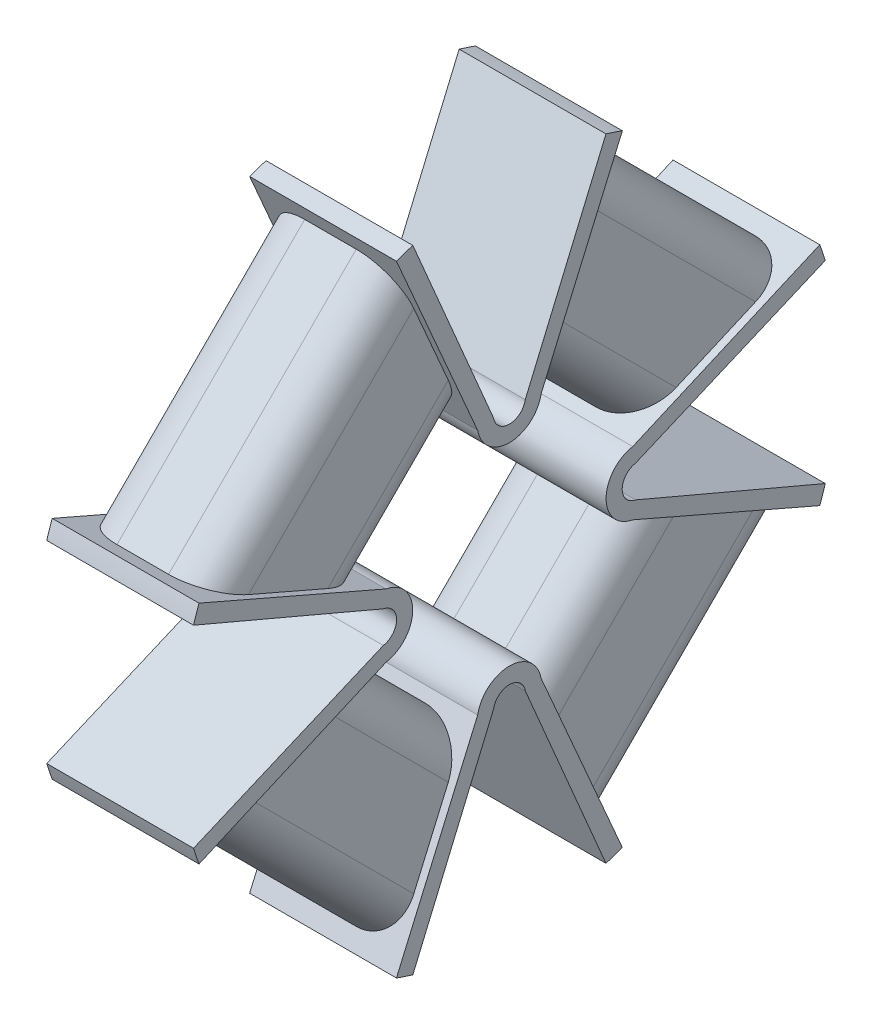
ISO-10303-21;
HEADER;
FILE_DESCRIPTION(('STEP AP214'),'2;1');
FILE_NAME('part.step','',(''),(''),'','','');
FILE_SCHEMA(('AUTOMOTIVE_DESIGN { 1 0 10303 214 1 1 1 1 }'));
ENDSEC;
DATA;
#1=APPLICATION_CONTEXT('core data for automotive mechanical design processes');
#2=APPLICATION_PROTOCOL_DEFINITION('international standard','automotive_design',2000,#1);
#3=PRODUCT_CONTEXT('',#1,'mechanical');
#4=PRODUCT('Part','Part','',(#3));
#5=PRODUCT_RELATED_PRODUCT_CATEGORY('part','',(#4));
#6=PRODUCT_DEFINITION_FORMATION('','',#4);
#7=PRODUCT_DEFINITION_CONTEXT('part definition',#1,'design');
#8=PRODUCT_DEFINITION('design','',#6,#7);
#9=PRODUCT_DEFINITION_SHAPE('','',#8);
#10=(LENGTH_UNIT() NAMED_UNIT(*) SI_UNIT(.MILLI.,.METRE.));
#11=(NAMED_UNIT(*) PLANE_ANGLE_UNIT() SI_UNIT($,.RADIAN.));
#12=(NAMED_UNIT(*) SI_UNIT($,.STERADIAN.) SOLID_ANGLE_UNIT());
#13=UNCERTAINTY_MEASURE_WITH_UNIT(LENGTH_MEASURE(1.E-05),#10,'distance_accuracy_value','');
#14=(GEOMETRIC_REPRESENTATION_CONTEXT(3) GLOBAL_UNCERTAINTY_ASSIGNED_CONTEXT((#13)) GLOBAL_UNIT_ASSIGNED_CONTEXT((#10,
#11,#12)) REPRESENTATION_CONTEXT('',''));
#15=CARTESIAN_POINT('',(0.,0.,0.));
#16=DIRECTION('',(0.,0.,1.));
#17=DIRECTION('',(1.,0.,0.));
#18=AXIS2_PLACEMENT_3D('',#15,#16,#17);
#19=CARTESIAN_POINT('',(-5.5,17.643822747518,-5.39425795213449));
#20=DIRECTION('',(0.,-0.391352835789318,-0.920240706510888));
#21=DIRECTION('',(0.,0.920240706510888,-0.391352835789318));
#22=AXIS2_PLACEMENT_3D('',#19,#20,#21);
#23=PLANE('',#22);
#24=DIRECTION('',(1.,0.,0.));
#25=VECTOR('',#24,1.);
#26=CARTESIAN_POINT('',(-4.1,17.643822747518,-5.39425795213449));
#27=LINE('',#26,#25);
#28=CARTESIAN_POINT('',(-4.1,17.643822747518,-5.39425795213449));
#29=VERTEX_POINT('',#28);
#30=CARTESIAN_POINT('',(4.1,17.643822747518,-5.39425795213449));
#31=VERTEX_POINT('',#30);
#32=EDGE_CURVE('E419',#29,#31,#27,.T.);
#33=ORIENTED_EDGE('',*,*,#32,.F.);
#34=DIRECTION('',(0.,-0.920240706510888,0.391352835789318));
#35=VECTOR('',#34,1.);
#36=CARTESIAN_POINT('',(-4.1,17.643822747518,-5.39425795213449));
#37=LINE('',#36,#35);
#38=CARTESIAN_POINT('',(-4.1,7.04371664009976,-0.88632697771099));
#39=VERTEX_POINT('',#38);
#40=EDGE_CURVE('E660',#29,#39,#37,.T.);
#41=ORIENTED_EDGE('',*,*,#40,.T.);
#42=DIRECTION('',(1.,0.,0.));
#43=VECTOR('',#42,1.);
#44=CARTESIAN_POINT('',(-6.6,7.04371664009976,-0.88632697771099));
#45=LINE('',#44,#43);
#46=CARTESIAN_POINT('',(4.1,7.04371664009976,-0.886326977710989));
#47=VERTEX_POINT('',#46);
#48=EDGE_CURVE('E448',#39,#47,#45,.T.);
#49=ORIENTED_EDGE('',*,*,#48,.T.);
#50=DIRECTION('',(0.,-0.920240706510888,0.391352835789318));
#51=VECTOR('',#50,1.);
#52=CARTESIAN_POINT('',(4.1,17.643822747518,-5.39425795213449));
#53=LINE('',#52,#51);
#54=EDGE_CURVE('E423',#31,#47,#53,.T.);
#55=ORIENTED_EDGE('',*,*,#54,.F.);
#56=EDGE_LOOP('',(#33,#41,#49,#55));
#57=FACE_BOUND('',#56,.T.);
#58=ADVANCED_FACE('F16',(#57),#23,.F.);
#59=CARTESIAN_POINT('',(-6.6,7.2,0.));
#60=DIRECTION('',(1.,0.,0.));
#61=DIRECTION('',(0.,0.,-1.));
#62=AXIS2_PLACEMENT_3D('',#59,#60,#61);
#63=CYLINDRICAL_SURFACE('',#62,0.9);
#64=ORIENTED_EDGE('',*,*,#48,.F.);
#65=CARTESIAN_POINT('',(-4.1,7.2,0.));
#66=DIRECTION('',(1.,0.,0.));
#67=DIRECTION('',(0.,0.,-1.));
#68=AXIS2_PLACEMENT_3D('',#65,#66,#67);
#69=CIRCLE('',#68,0.9);
#70=CARTESIAN_POINT('',(-4.1,7.04371664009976,0.886326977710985));
#71=VERTEX_POINT('',#70);
#72=EDGE_CURVE('E657',#39,#71,#69,.F.);
#73=ORIENTED_EDGE('',*,*,#72,.T.);
#74=DIRECTION('',(1.,0.,0.));
#75=VECTOR('',#74,1.);
#76=CARTESIAN_POINT('',(-5.5,7.04371664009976,0.886326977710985));
#77=LINE('',#76,#75);
#78=CARTESIAN_POINT('',(4.1,7.04371664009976,0.886326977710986));
#79=VERTEX_POINT('',#78);
#80=EDGE_CURVE('E446',#71,#79,#77,.T.);
#81=ORIENTED_EDGE('',*,*,#80,.T.);
#82=CARTESIAN_POINT('',(4.1,7.2,0.));
#83=DIRECTION('',(1.,0.,0.));
#84=DIRECTION('',(0.,0.,-1.));
#85=AXIS2_PLACEMENT_3D('',#82,#83,#84);
#86=CIRCLE('',#85,0.9);
#87=EDGE_CURVE('E455',#47,#79,#86,.F.);
#88=ORIENTED_EDGE('',*,*,#87,.F.);
#89=EDGE_LOOP('',(#64,#73,#81,#88));
#90=FACE_BOUND('',#89,.T.);
#91=ADVANCED_FACE('F1235',(#90),#63,.F.);
#92=CARTESIAN_POINT('',(-5.5,7.04371664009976,0.886326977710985));
#93=DIRECTION('',(0.,-0.391352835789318,0.920240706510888));
#94=DIRECTION('',(0.,-0.920240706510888,-0.391352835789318));
#95=AXIS2_PLACEMENT_3D('',#92,#93,#94);
#96=PLANE('',#95);
#97=ORIENTED_EDGE('',*,*,#80,.F.);
#98=DIRECTION('',(0.,0.920240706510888,0.391352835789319));
#99=VECTOR('',#98,1.);
#100=CARTESIAN_POINT('',(-4.1,7.04371664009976,0.886326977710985));
#101=LINE('',#100,#99);
#102=CARTESIAN_POINT('',(-4.1,17.643822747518,5.39425795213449));
#103=VERTEX_POINT('',#102);
#104=EDGE_CURVE('E656',#71,#103,#101,.T.);
#105=ORIENTED_EDGE('',*,*,#104,.T.);
#106=DIRECTION('',(1.,0.,0.));
#107=VECTOR('',#106,1.);
#108=CARTESIAN_POINT('',(-4.1,17.643822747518,5.39425795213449));
#109=LINE('',#108,#107);
#110=CARTESIAN_POINT('',(4.1,17.643822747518,5.39425795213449));
#111=VERTEX_POINT('',#110);
#112=EDGE_CURVE('E452',#111,#103,#109,.F.);
#113=ORIENTED_EDGE('',*,*,#112,.F.);
#114=DIRECTION('',(0.,0.920240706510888,0.391352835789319));
#115=VECTOR('',#114,1.);
#116=CARTESIAN_POINT('',(4.1,7.04371664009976,0.886326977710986));
#117=LINE('',#116,#115);
#118=EDGE_CURVE('E424',#79,#111,#117,.T.);
#119=ORIENTED_EDGE('',*,*,#118,.F.);
#120=EDGE_LOOP('',(#97,#105,#113,#119));
#121=FACE_BOUND('',#120,.T.);
#122=ADVANCED_FACE('F1231',(#121),#96,.F.);
#123=CARTESIAN_POINT('',(-4.1,0.,0.));
#124=DIRECTION('',(1.,0.,0.));
#125=DIRECTION('',(0.,0.,-1.));
#126=AXIS2_PLACEMENT_3D('',#123,#124,#125);
#127=CYLINDRICAL_SURFACE('',#126,18.45);
#128=DIRECTION('',(1.,0.,0.));
#129=VECTOR('',#128,1.);
#130=CARTESIAN_POINT('',(-4.1,17.3373288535,-6.31027164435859));
#131=LINE('',#130,#129);
#132=CARTESIAN_POINT('',(-4.1,17.3373288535,-6.31027164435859));
#133=VERTEX_POINT('',#132);
#134=CARTESIAN_POINT('',(4.1,17.3373288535,-6.31027164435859));
#135=VERTEX_POINT('',#134);
#136=EDGE_CURVE('E418',#133,#135,#131,.T.);
#137=ORIENTED_EDGE('',*,*,#136,.F.);
#138=CARTESIAN_POINT('',(-4.1,0.,0.));
#139=DIRECTION('',(1.,0.,0.));
#140=DIRECTION('',(0.,0.,-1.));
#141=AXIS2_PLACEMENT_3D('',#138,#139,#140);
#142=CIRCLE('',#141,18.45);
#143=EDGE_CURVE('E661',#133,#29,#142,.T.);
#144=ORIENTED_EDGE('',*,*,#143,.T.);
#145=ORIENTED_EDGE('',*,*,#32,.T.);
#146=CARTESIAN_POINT('',(4.1,0.,0.));
#147=DIRECTION('',(1.,0.,0.));
#148=DIRECTION('',(0.,0.,-1.));
#149=AXIS2_PLACEMENT_3D('',#146,#147,#148);
#150=CIRCLE('',#149,18.45);
#151=EDGE_CURVE('E20',#135,#31,#150,.T.);
#152=ORIENTED_EDGE('',*,*,#151,.F.);
#153=EDGE_LOOP('',(#137,#144,#145,#152));
#154=FACE_BOUND('',#153,.T.);
#155=ADVANCED_FACE('F416',(#154),#127,.T.);
#156=CARTESIAN_POINT('',(4.1,13.2252118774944,0.));
#157=DIRECTION('',(1.,0.,0.));
#158=DIRECTION('',(0.,0.,-1.));
#159=AXIS2_PLACEMENT_3D('',#156,#157,#158);
#160=PLANE('',#159);
#161=ORIENTED_EDGE('',*,*,#54,.T.);
#162=ORIENTED_EDGE('',*,*,#87,.T.);
#163=ORIENTED_EDGE('',*,*,#118,.T.);
#164=CARTESIAN_POINT('',(4.1,0.,0.));
#165=DIRECTION('',(1.,0.,0.));
#166=DIRECTION('',(0.,0.,-1.));
#167=AXIS2_PLACEMENT_3D('',#164,#165,#166);
#168=CIRCLE('',#167,18.45);
#169=CARTESIAN_POINT('',(4.1,17.3373288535,6.31027164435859));
#170=VERTEX_POINT('',#169);
#171=EDGE_CURVE('E454',#170,#111,#168,.F.);
#172=ORIENTED_EDGE('',*,*,#171,.F.);
#173=DIRECTION('',(0.,-0.917256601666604,-0.398296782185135));
#174=VECTOR('',#173,1.);
#175=CARTESIAN_POINT('',(4.1,6.88743328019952,1.77265395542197));
#176=LINE('',#175,#174);
#177=CARTESIAN_POINT('',(4.1,6.88743328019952,1.77265395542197));
#178=VERTEX_POINT('',#177);
#179=EDGE_CURVE('E433',#178,#170,#176,.F.);
#180=ORIENTED_EDGE('',*,*,#179,.F.);
#181=CARTESIAN_POINT('',(4.1,7.2,0.));
#182=DIRECTION('',(1.,0.,0.));
#183=DIRECTION('',(0.,0.,-1.));
#184=AXIS2_PLACEMENT_3D('',#181,#182,#183);
#185=CIRCLE('',#184,1.8);
#186=CARTESIAN_POINT('',(4.1,6.88743328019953,-1.77265395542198));
#187=VERTEX_POINT('',#186);
#188=EDGE_CURVE('E437',#187,#178,#185,.F.);
#189=ORIENTED_EDGE('',*,*,#188,.F.);
#190=DIRECTION('',(0.,0.917256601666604,-0.398296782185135));
#191=VECTOR('',#190,1.);
#192=CARTESIAN_POINT('',(4.1,17.3373288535,-6.31027164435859));
#193=LINE('',#192,#191);
#194=EDGE_CURVE('E429',#135,#187,#193,.F.);
#195=ORIENTED_EDGE('',*,*,#194,.F.);
#196=ORIENTED_EDGE('',*,*,#151,.T.);
#197=EDGE_LOOP('',(#161,#162,#163,#172,#180,#189,#195,#196));
#198=FACE_BOUND('',#197,.T.);
#199=ADVANCED_FACE('F435',(#198),#160,.T.);
#200=CARTESIAN_POINT('',(-4.1,0.,0.));
#201=DIRECTION('',(1.,0.,0.));
#202=DIRECTION('',(0.,0.,-1.));
#203=AXIS2_PLACEMENT_3D('',#200,#201,#202);
#204=CYLINDRICAL_SURFACE('',#203,18.45);
#205=DIRECTION('',(1.,0.,0.));
#206=VECTOR('',#205,1.);
#207=CARTESIAN_POINT('',(-4.1,17.3373288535,6.31027164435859));
#208=LINE('',#207,#206);
#209=CARTESIAN_POINT('',(-4.1,17.3373288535,6.31027164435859));
#210=VERTEX_POINT('',#209);
#211=EDGE_CURVE('E883',#170,#210,#208,.F.);
#212=ORIENTED_EDGE('',*,*,#211,.F.);
#213=ORIENTED_EDGE('',*,*,#171,.T.);
#214=ORIENTED_EDGE('',*,*,#112,.T.);
#215=CARTESIAN_POINT('',(-4.1,0.,0.));
#216=DIRECTION('',(1.,0.,0.));
#217=DIRECTION('',(0.,0.,-1.));
#218=AXIS2_PLACEMENT_3D('',#215,#216,#217);
#219=CIRCLE('',#218,18.45);
#220=EDGE_CURVE('E663',#103,#210,#219,.T.);
#221=ORIENTED_EDGE('',*,*,#220,.T.);
#222=EDGE_LOOP('',(#212,#213,#214,#221));
#223=FACE_BOUND('',#222,.T.);
#224=ADVANCED_FACE('F896',(#223),#204,.T.);
#225=CARTESIAN_POINT('',(-4.1,13.2252118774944,0.));
#226=DIRECTION('',(1.,0.,0.));
#227=DIRECTION('',(0.,0.,-1.));
#228=AXIS2_PLACEMENT_3D('',#225,#226,#227);
#229=PLANE('',#228);
#230=ORIENTED_EDGE('',*,*,#72,.F.);
#231=ORIENTED_EDGE('',*,*,#40,.F.);
#232=ORIENTED_EDGE('',*,*,#143,.F.);
#233=DIRECTION('',(0.,0.917256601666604,-0.398296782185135));
#234=VECTOR('',#233,1.);
#235=CARTESIAN_POINT('',(-4.1,17.3373288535,-6.31027164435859));
#236=LINE('',#235,#234);
#237=CARTESIAN_POINT('',(-4.1,6.88743328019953,-1.77265395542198));
#238=VERTEX_POINT('',#237);
#239=EDGE_CURVE('E432',#238,#133,#236,.T.);
#240=ORIENTED_EDGE('',*,*,#239,.F.);
#241=CARTESIAN_POINT('',(-4.1,7.2,0.));
#242=DIRECTION('',(1.,0.,0.));
#243=DIRECTION('',(0.,0.,-1.));
#244=AXIS2_PLACEMENT_3D('',#241,#242,#243);
#245=CIRCLE('',#244,1.8);
#246=CARTESIAN_POINT('',(-4.1,6.88743328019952,1.77265395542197));
#247=VERTEX_POINT('',#246);
#248=EDGE_CURVE('E440',#247,#238,#245,.T.);
#249=ORIENTED_EDGE('',*,*,#248,.F.);
#250=DIRECTION('',(0.,-0.917256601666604,-0.398296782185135));
#251=VECTOR('',#250,1.);
#252=CARTESIAN_POINT('',(-4.1,6.88743328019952,1.77265395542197));
#253=LINE('',#252,#251);
#254=EDGE_CURVE('E885',#210,#247,#253,.T.);
#255=ORIENTED_EDGE('',*,*,#254,.F.);
#256=ORIENTED_EDGE('',*,*,#220,.F.);
#257=ORIENTED_EDGE('',*,*,#104,.F.);
#258=EDGE_LOOP('',(#230,#231,#232,#240,#249,#255,#256,#257));
#259=FACE_BOUND('',#258,.T.);
#260=ADVANCED_FACE('F903',(#259),#229,.F.);
#261=CARTESIAN_POINT('',(-4.1,7.2,0.));
#262=DIRECTION('',(1.,0.,0.));
#263=DIRECTION('',(0.,0.,-1.));
#264=AXIS2_PLACEMENT_3D('',#261,#262,#263);
#265=CYLINDRICAL_SURFACE('',#264,1.8);
#266=ORIENTED_EDGE('',*,*,#248,.T.);
#267=DIRECTION('',(1.,0.,0.));
#268=VECTOR('',#267,1.);
#269=CARTESIAN_POINT('',(-4.1,6.88743328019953,-1.77265395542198));
#270=LINE('',#269,#268);
#271=EDGE_CURVE('E439',#187,#238,#270,.F.);
#272=ORIENTED_EDGE('',*,*,#271,.F.);
#273=ORIENTED_EDGE('',*,*,#188,.T.);
#274=DIRECTION('',(1.,0.,0.));
#275=VECTOR('',#274,1.);
#276=CARTESIAN_POINT('',(-4.1,6.88743328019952,1.77265395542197));
#277=LINE('',#276,#275);
#278=EDGE_CURVE('E879',#247,#178,#277,.T.);
#279=ORIENTED_EDGE('',*,*,#278,.F.);
#280=EDGE_LOOP('',(#266,#272,#273,#279));
#281=FACE_BOUND('',#280,.T.);
#282=ADVANCED_FACE('F905',(#281),#265,.T.);
#283=CARTESIAN_POINT('',(-4.1,17.3373288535,-6.31027164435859));
#284=DIRECTION('',(0.,-0.398296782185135,-0.917256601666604));
#285=DIRECTION('',(0.,0.917256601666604,-0.398296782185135));
#286=AXIS2_PLACEMENT_3D('',#283,#284,#285);
#287=PLANE('',#286);
#288=CARTESIAN_POINT('',(1.44,14.1608998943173,-4.93098319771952));
#289=DIRECTION('',(0.,-0.398296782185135,-0.917256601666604));
#290=DIRECTION('',(0.,0.917256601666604,-0.398296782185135));
#291=AXIS2_PLACEMENT_3D('',#288,#289,#290);
#292=ELLIPSE('',#291,2.41873918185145,2.25);
#293=CARTESIAN_POINT('',(1.44,16.3795043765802,-5.89435923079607));
#294=VERTEX_POINT('',#293);
#295=CARTESIAN_POINT('',(3.69,14.1608998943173,-4.93098319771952));
#296=VERTEX_POINT('',#295);
#297=EDGE_CURVE('E640',#294,#296,#292,.T.);
#298=ORIENTED_EDGE('',*,*,#297,.F.);
#299=DIRECTION('',(1.,0.,0.));
#300=VECTOR('',#299,1.);
#301=CARTESIAN_POINT('',(-1.44,16.3795043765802,-5.89435923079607));
#302=LINE('',#301,#300);
#303=CARTESIAN_POINT('',(-1.44,16.3795043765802,-5.89435923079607));
#304=VERTEX_POINT('',#303);
#305=EDGE_CURVE('E689',#304,#294,#302,.T.);
#306=ORIENTED_EDGE('',*,*,#305,.F.);
#307=CARTESIAN_POINT('',(-1.44,14.1608998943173,-4.93098319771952));
#308=DIRECTION('',(0.,-0.398296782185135,-0.917256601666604));
#309=DIRECTION('',(0.,0.917256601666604,-0.398296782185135));
#310=AXIS2_PLACEMENT_3D('',#307,#308,#309);
#311=ELLIPSE('',#310,2.41873918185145,2.25);
#312=CARTESIAN_POINT('',(-3.69,14.1608998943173,-4.93098319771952));
#313=VERTEX_POINT('',#312);
#314=EDGE_CURVE('E643',#313,#304,#311,.T.);
#315=ORIENTED_EDGE('',*,*,#314,.F.);
#316=DIRECTION('',(0.,0.917256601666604,-0.398296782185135));
#317=VECTOR('',#316,1.);
#318=CARTESIAN_POINT('',(-3.69,9.72369092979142,-3.00423113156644));
#319=LINE('',#318,#317);
#320=CARTESIAN_POINT('',(-3.69,9.72369092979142,-3.00423113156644));
#321=VERTEX_POINT('',#320);
#322=EDGE_CURVE('E685',#321,#313,#319,.T.);
#323=ORIENTED_EDGE('',*,*,#322,.F.);
#324=CARTESIAN_POINT('',(-1.44,9.72369092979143,-3.00423113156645));
#325=DIRECTION('',(0.,-0.398296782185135,-0.917256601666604));
#326=DIRECTION('',(0.,0.917256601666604,-0.398296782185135));
#327=AXIS2_PLACEMENT_3D('',#324,#325,#326);
#328=ELLIPSE('',#327,2.41873918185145,2.25);
#329=CARTESIAN_POINT('',(-1.44,7.5050864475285,-2.04085509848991));
#330=VERTEX_POINT('',#329);
#331=EDGE_CURVE('E647',#330,#321,#328,.T.);
#332=ORIENTED_EDGE('',*,*,#331,.F.);
#333=DIRECTION('',(1.,0.,0.));
#334=VECTOR('',#333,1.);
#335=CARTESIAN_POINT('',(1.44,7.5050864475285,-2.04085509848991));
#336=LINE('',#335,#334);
#337=CARTESIAN_POINT('',(1.44,7.5050864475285,-2.04085509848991));
#338=VERTEX_POINT('',#337);
#339=EDGE_CURVE('E682',#338,#330,#336,.F.);
#340=ORIENTED_EDGE('',*,*,#339,.F.);
#341=CARTESIAN_POINT('',(1.44,9.72369092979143,-3.00423113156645));
#342=DIRECTION('',(0.,-0.398296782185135,-0.917256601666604));
#343=DIRECTION('',(0.,0.917256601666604,-0.398296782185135));
#344=AXIS2_PLACEMENT_3D('',#341,#342,#343);
#345=ELLIPSE('',#344,2.41873918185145,2.25);
#346=CARTESIAN_POINT('',(3.69,9.72369092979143,-3.00423113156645));
#347=VERTEX_POINT('',#346);
#348=EDGE_CURVE('E651',#347,#338,#345,.T.);
#349=ORIENTED_EDGE('',*,*,#348,.F.);
#350=DIRECTION('',(0.,-0.917256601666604,0.398296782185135));
#351=VECTOR('',#350,1.);
#352=CARTESIAN_POINT('',(3.69,14.1608998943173,-4.93098319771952));
#353=LINE('',#352,#351);
#354=EDGE_CURVE('E679',#296,#347,#353,.T.);
#355=ORIENTED_EDGE('',*,*,#354,.F.);
#356=EDGE_LOOP('',(#298,#306,#315,#323,#332,#340,#349,#355));
#357=FACE_BOUND('',#356,.T.);
#358=ORIENTED_EDGE('',*,*,#239,.T.);
#359=ORIENTED_EDGE('',*,*,#136,.T.);
#360=ORIENTED_EDGE('',*,*,#194,.T.);
#361=ORIENTED_EDGE('',*,*,#271,.T.);
#362=EDGE_LOOP('',(#358,#359,#360,#361));
#363=FACE_BOUND('',#362,.T.);
#364=ADVANCED_FACE('F427',(#357,#363),#287,.T.);
#365=CARTESIAN_POINT('',(-4.1,6.88743328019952,1.77265395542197));
#366=DIRECTION('',(0.,-0.398296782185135,0.917256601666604));
#367=DIRECTION('',(0.,-0.917256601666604,-0.398296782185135));
#368=AXIS2_PLACEMENT_3D('',#365,#366,#367);
#369=PLANE('',#368);
#370=CARTESIAN_POINT('',(-1.44,9.72369092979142,3.00423113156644));
#371=DIRECTION('',(0.,-0.398296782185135,0.917256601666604));
#372=DIRECTION('',(0.,-0.917256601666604,-0.398296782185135));
#373=AXIS2_PLACEMENT_3D('',#370,#371,#372);
#374=ELLIPSE('',#373,2.41873918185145,2.25);
#375=CARTESIAN_POINT('',(-3.69,9.72369092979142,3.00423113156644));
#376=VERTEX_POINT('',#375);
#377=CARTESIAN_POINT('',(-1.44,7.50508644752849,2.0408550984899));
#378=VERTEX_POINT('',#377);
#379=EDGE_CURVE('E628',#376,#378,#374,.T.);
#380=ORIENTED_EDGE('',*,*,#379,.F.);
#381=DIRECTION('',(0.,-0.917256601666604,-0.398296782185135));
#382=VECTOR('',#381,1.);
#383=CARTESIAN_POINT('',(-3.69,14.1608998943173,4.93098319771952));
#384=LINE('',#383,#382);
#385=CARTESIAN_POINT('',(-3.69,14.1608998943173,4.93098319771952));
#386=VERTEX_POINT('',#385);
#387=EDGE_CURVE('E860',#386,#376,#384,.T.);
#388=ORIENTED_EDGE('',*,*,#387,.F.);
#389=CARTESIAN_POINT('',(-1.44,14.1608998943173,4.93098319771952));
#390=DIRECTION('',(0.,-0.398296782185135,0.917256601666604));
#391=DIRECTION('',(0.,-0.917256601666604,-0.398296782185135));
#392=AXIS2_PLACEMENT_3D('',#389,#390,#391);
#393=ELLIPSE('',#392,2.41873918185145,2.25);
#394=CARTESIAN_POINT('',(-1.44,16.3795043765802,5.89435923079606));
#395=VERTEX_POINT('',#394);
#396=EDGE_CURVE('E616',#395,#386,#393,.T.);
#397=ORIENTED_EDGE('',*,*,#396,.F.);
#398=DIRECTION('',(1.,0.,0.));
#399=VECTOR('',#398,1.);
#400=CARTESIAN_POINT('',(-1.44,16.3795043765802,5.89435923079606));
#401=LINE('',#400,#399);
#402=CARTESIAN_POINT('',(1.44,16.3795043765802,5.89435923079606));
#403=VERTEX_POINT('',#402);
#404=EDGE_CURVE('E698',#403,#395,#401,.F.);
#405=ORIENTED_EDGE('',*,*,#404,.F.);
#406=CARTESIAN_POINT('',(1.44,14.1608998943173,4.93098319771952));
#407=DIRECTION('',(0.,-0.398296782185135,0.917256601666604));
#408=DIRECTION('',(0.,-0.917256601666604,-0.398296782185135));
#409=AXIS2_PLACEMENT_3D('',#406,#407,#408);
#410=ELLIPSE('',#409,2.41873918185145,2.25);
#411=CARTESIAN_POINT('',(3.69,14.1608998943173,4.93098319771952));
#412=VERTEX_POINT('',#411);
#413=EDGE_CURVE('E620',#412,#403,#410,.T.);
#414=ORIENTED_EDGE('',*,*,#413,.F.);
#415=DIRECTION('',(0.,0.917256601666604,0.398296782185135));
#416=VECTOR('',#415,1.);
#417=CARTESIAN_POINT('',(3.69,9.72369092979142,3.00423113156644));
#418=LINE('',#417,#416);
#419=CARTESIAN_POINT('',(3.69,9.72369092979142,3.00423113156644));
#420=VERTEX_POINT('',#419);
#421=EDGE_CURVE('E695',#420,#412,#418,.T.);
#422=ORIENTED_EDGE('',*,*,#421,.F.);
#423=CARTESIAN_POINT('',(1.44,9.72369092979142,3.00423113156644));
#424=DIRECTION('',(0.,-0.398296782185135,0.917256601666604));
#425=DIRECTION('',(0.,-0.917256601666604,-0.398296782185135));
#426=AXIS2_PLACEMENT_3D('',#423,#424,#425);
#427=ELLIPSE('',#426,2.41873918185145,2.25);
#428=CARTESIAN_POINT('',(1.44,7.50508644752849,2.0408550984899));
#429=VERTEX_POINT('',#428);
#430=EDGE_CURVE('E624',#429,#420,#427,.T.);
#431=ORIENTED_EDGE('',*,*,#430,.F.);
#432=DIRECTION('',(1.,0.,0.));
#433=VECTOR('',#432,1.);
#434=CARTESIAN_POINT('',(1.44,7.50508644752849,2.0408550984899));
#435=LINE('',#434,#433);
#436=EDGE_CURVE('E692',#378,#429,#435,.T.);
#437=ORIENTED_EDGE('',*,*,#436,.F.);
#438=EDGE_LOOP('',(#380,#388,#397,#405,#414,#422,#431,#437));
#439=FACE_BOUND('',#438,.T.);
#440=ORIENTED_EDGE('',*,*,#254,.T.);
#441=ORIENTED_EDGE('',*,*,#278,.T.);
#442=ORIENTED_EDGE('',*,*,#179,.T.);
#443=ORIENTED_EDGE('',*,*,#211,.T.);
#444=EDGE_LOOP('',(#440,#441,#442,#443));
#445=FACE_BOUND('',#444,.T.);
#446=ADVANCED_FACE('F891',(#439,#445),#369,.T.);
#447=CARTESIAN_POINT('',(3.69,19.0918830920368,0.));
#448=DIRECTION('',(1.,0.,0.));
#449=DIRECTION('',(0.,0.,-1.));
#450=AXIS2_PLACEMENT_3D('',#447,#448,#449);
#451=PLANE('',#450);
#452=ORIENTED_EDGE('',*,*,#354,.T.);
#453=DIRECTION('',(0.,0.707106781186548,0.707106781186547));
#454=VECTOR('',#453,1.);
#455=CARTESIAN_POINT('',(3.69,-3.18198051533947,-15.9099025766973));
#456=LINE('',#455,#454);
#457=CARTESIAN_POINT('',(3.69,3.00423113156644,-9.72369092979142));
#458=VERTEX_POINT('',#457);
#459=EDGE_CURVE('E653',#458,#347,#456,.T.);
#460=ORIENTED_EDGE('',*,*,#459,.F.);
#461=DIRECTION('',(0.,-0.398296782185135,0.917256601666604));
#462=VECTOR('',#461,1.);
#463=CARTESIAN_POINT('',(3.69,1.77265395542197,-6.88743328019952));
#464=LINE('',#463,#462);
#465=CARTESIAN_POINT('',(3.69,4.93098319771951,-14.1608998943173));
#466=VERTEX_POINT('',#465);
#467=EDGE_CURVE('E615',#466,#458,#464,.T.);
#468=ORIENTED_EDGE('',*,*,#467,.F.);
#469=DIRECTION('',(0.,0.707106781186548,0.707106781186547));
#470=VECTOR('',#469,1.);
#471=CARTESIAN_POINT('',(3.69,0.,-19.0918830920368));
#472=LINE('',#471,#470);
#473=EDGE_CURVE('E639',#296,#466,#472,.F.);
#474=ORIENTED_EDGE('',*,*,#473,.F.);
#475=EDGE_LOOP('',(#452,#460,#468,#474));
#476=FACE_BOUND('',#475,.T.);
#477=ADVANCED_FACE('F1167',(#476),#451,.T.);
#478=CARTESIAN_POINT('',(1.44,-3.18198051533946,-15.9099025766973));
#479=DIRECTION('',(0.,0.707106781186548,0.707106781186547));
#480=DIRECTION('',(0.,-0.707106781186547,0.707106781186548));
#481=AXIS2_PLACEMENT_3D('',#478,#479,#480);
#482=CYLINDRICAL_SURFACE('',#481,2.25);
#483=ORIENTED_EDGE('',*,*,#348,.T.);
#484=DIRECTION('',(0.,-0.707106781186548,-0.707106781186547));
#485=VECTOR('',#484,1.);
#486=CARTESIAN_POINT('',(1.44,-4.7729707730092,-14.3189123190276));
#487=LINE('',#486,#485);
#488=CARTESIAN_POINT('',(1.44,2.0408550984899,-7.5050864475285));
#489=VERTEX_POINT('',#488);
#490=EDGE_CURVE('E652',#489,#338,#487,.F.);
#491=ORIENTED_EDGE('',*,*,#490,.F.);
#492=CARTESIAN_POINT('',(1.44,3.00423113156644,-9.72369092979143));
#493=DIRECTION('',(0.,0.917256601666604,0.398296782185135));
#494=DIRECTION('',(0.,-0.398296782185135,0.917256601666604));
#495=AXIS2_PLACEMENT_3D('',#492,#493,#494);
#496=ELLIPSE('',#495,2.41873918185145,2.25);
#497=EDGE_CURVE('E613',#458,#489,#496,.F.);
#498=ORIENTED_EDGE('',*,*,#497,.F.);
#499=ORIENTED_EDGE('',*,*,#459,.T.);
#500=EDGE_LOOP('',(#483,#491,#498,#499));
#501=FACE_BOUND('',#500,.T.);
#502=ADVANCED_FACE('F1163',(#501),#482,.T.);
#503=CARTESIAN_POINT('',(1.44,-4.7729707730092,-14.3189123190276));
#504=DIRECTION('',(0.,-0.707106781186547,0.707106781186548));
#505=DIRECTION('',(0.,-0.707106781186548,-0.707106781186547));
#506=AXIS2_PLACEMENT_3D('',#503,#504,#505);
#507=PLANE('',#506);
#508=ORIENTED_EDGE('',*,*,#339,.T.);
#509=DIRECTION('',(0.,0.707106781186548,0.707106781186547));
#510=VECTOR('',#509,1.);
#511=CARTESIAN_POINT('',(-1.44,-4.77297077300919,-14.3189123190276));
#512=LINE('',#511,#510);
#513=CARTESIAN_POINT('',(-1.44,2.0408550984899,-7.5050864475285));
#514=VERTEX_POINT('',#513);
#515=EDGE_CURVE('E650',#514,#330,#512,.T.);
#516=ORIENTED_EDGE('',*,*,#515,.F.);
#517=DIRECTION('',(1.,0.,0.));
#518=VECTOR('',#517,1.);
#519=CARTESIAN_POINT('',(-4.1,2.0408550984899,-7.50508644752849));
#520=LINE('',#519,#518);
#521=EDGE_CURVE('E612',#489,#514,#520,.F.);
#522=ORIENTED_EDGE('',*,*,#521,.F.);
#523=ORIENTED_EDGE('',*,*,#490,.T.);
#524=EDGE_LOOP('',(#508,#516,#522,#523));
#525=FACE_BOUND('',#524,.T.);
#526=ADVANCED_FACE('F1159',(#525),#507,.T.);
#527=CARTESIAN_POINT('',(-1.44,-3.18198051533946,-15.9099025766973));
#528=DIRECTION('',(0.,0.707106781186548,0.707106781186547));
#529=DIRECTION('',(0.,-0.707106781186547,0.707106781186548));
#530=AXIS2_PLACEMENT_3D('',#527,#528,#529);
#531=CYLINDRICAL_SURFACE('',#530,2.25);
#532=ORIENTED_EDGE('',*,*,#331,.T.);
#533=DIRECTION('',(0.,0.707106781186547,0.707106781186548));
#534=VECTOR('',#533,1.);
#535=CARTESIAN_POINT('',(-3.69,3.00423113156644,-9.72369092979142));
#536=LINE('',#535,#534);
#537=CARTESIAN_POINT('',(-3.69,3.00423113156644,-9.72369092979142));
#538=VERTEX_POINT('',#537);
#539=EDGE_CURVE('E649',#538,#321,#536,.T.);
#540=ORIENTED_EDGE('',*,*,#539,.F.);
#541=CARTESIAN_POINT('',(-1.44,3.00423113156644,-9.72369092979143));
#542=DIRECTION('',(0.,0.917256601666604,0.398296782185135));
#543=DIRECTION('',(0.,-0.398296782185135,0.917256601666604));
#544=AXIS2_PLACEMENT_3D('',#541,#542,#543);
#545=ELLIPSE('',#544,2.41873918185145,2.25);
#546=EDGE_CURVE('E610',#514,#538,#545,.F.);
#547=ORIENTED_EDGE('',*,*,#546,.F.);
#548=ORIENTED_EDGE('',*,*,#515,.T.);
#549=EDGE_LOOP('',(#532,#540,#547,#548));
#550=FACE_BOUND('',#549,.T.);
#551=ADVANCED_FACE('F1155',(#550),#531,.T.);
#552=CARTESIAN_POINT('',(-3.69,15.9099025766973,-3.18198051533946));
#553=DIRECTION('',(-1.,0.,0.));
#554=DIRECTION('',(0.,0.,1.));
#555=AXIS2_PLACEMENT_3D('',#552,#553,#554);
#556=PLANE('',#555);
#557=ORIENTED_EDGE('',*,*,#322,.T.);
#558=DIRECTION('',(0.,0.707106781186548,0.707106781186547));
#559=VECTOR('',#558,1.);
#560=CARTESIAN_POINT('',(-3.69,0.,-19.0918830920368));
#561=LINE('',#560,#559);
#562=CARTESIAN_POINT('',(-3.69,4.93098319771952,-14.1608998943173));
#563=VERTEX_POINT('',#562);
#564=EDGE_CURVE('E646',#563,#313,#561,.T.);
#565=ORIENTED_EDGE('',*,*,#564,.F.);
#566=DIRECTION('',(0.,-0.398296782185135,0.917256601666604));
#567=VECTOR('',#566,1.);
#568=CARTESIAN_POINT('',(-3.69,1.77265395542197,-6.88743328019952));
#569=LINE('',#568,#567);
#570=EDGE_CURVE('E609',#538,#563,#569,.F.);
#571=ORIENTED_EDGE('',*,*,#570,.F.);
#572=ORIENTED_EDGE('',*,*,#539,.T.);
#573=EDGE_LOOP('',(#557,#565,#571,#572));
#574=FACE_BOUND('',#573,.T.);
#575=ADVANCED_FACE('F1151',(#574),#556,.T.);
#576=CARTESIAN_POINT('',(-1.44,0.,-19.0918830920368));
#577=DIRECTION('',(0.,0.707106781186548,0.707106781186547));
#578=DIRECTION('',(0.,-0.707106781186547,0.707106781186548));
#579=AXIS2_PLACEMENT_3D('',#576,#577,#578);
#580=CYLINDRICAL_SURFACE('',#579,2.25);
#581=ORIENTED_EDGE('',*,*,#314,.T.);
#582=DIRECTION('',(0.,0.707106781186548,0.707106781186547));
#583=VECTOR('',#582,1.);
#584=CARTESIAN_POINT('',(-1.44,1.59099025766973,-20.6828733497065));
#585=LINE('',#584,#583);
#586=CARTESIAN_POINT('',(-1.44,5.89435923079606,-16.3795043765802));
#587=VERTEX_POINT('',#586);
#588=EDGE_CURVE('E645',#587,#304,#585,.T.);
#589=ORIENTED_EDGE('',*,*,#588,.F.);
#590=CARTESIAN_POINT('',(-1.44,4.93098319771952,-14.1608998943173));
#591=DIRECTION('',(0.,0.917256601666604,0.398296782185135));
#592=DIRECTION('',(0.,-0.398296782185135,0.917256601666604));
#593=AXIS2_PLACEMENT_3D('',#590,#591,#592);
#594=ELLIPSE('',#593,2.41873918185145,2.25);
#595=EDGE_CURVE('E607',#563,#587,#594,.F.);
#596=ORIENTED_EDGE('',*,*,#595,.F.);
#597=ORIENTED_EDGE('',*,*,#564,.T.);
#598=EDGE_LOOP('',(#581,#589,#596,#597));
#599=FACE_BOUND('',#598,.T.);
#600=ADVANCED_FACE('F1147',(#599),#580,.T.);
#601=CARTESIAN_POINT('',(-1.44,1.59099025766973,-20.6828733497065));
#602=DIRECTION('',(0.,0.707106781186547,-0.707106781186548));
#603=DIRECTION('',(0.,0.707106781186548,0.707106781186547));
#604=AXIS2_PLACEMENT_3D('',#601,#602,#603);
#605=PLANE('',#604);
#606=ORIENTED_EDGE('',*,*,#305,.T.);
#607=DIRECTION('',(0.,0.707106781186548,0.707106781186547));
#608=VECTOR('',#607,1.);
#609=CARTESIAN_POINT('',(1.44,1.59099025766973,-20.6828733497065));
#610=LINE('',#609,#608);
#611=CARTESIAN_POINT('',(1.44,5.89435923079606,-16.3795043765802));
#612=VERTEX_POINT('',#611);
#613=EDGE_CURVE('E642',#612,#294,#610,.T.);
#614=ORIENTED_EDGE('',*,*,#613,.F.);
#615=DIRECTION('',(1.,0.,0.));
#616=VECTOR('',#615,1.);
#617=CARTESIAN_POINT('',(-4.1,5.89435923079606,-16.3795043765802));
#618=LINE('',#617,#616);
#619=EDGE_CURVE('E606',#587,#612,#618,.T.);
#620=ORIENTED_EDGE('',*,*,#619,.F.);
#621=ORIENTED_EDGE('',*,*,#588,.T.);
#622=EDGE_LOOP('',(#606,#614,#620,#621));
#623=FACE_BOUND('',#622,.T.);
#624=ADVANCED_FACE('F1143',(#623),#605,.T.);
#625=CARTESIAN_POINT('',(1.44,0.,-19.0918830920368));
#626=DIRECTION('',(0.,0.707106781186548,0.707106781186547));
#627=DIRECTION('',(0.,-0.707106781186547,0.707106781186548));
#628=AXIS2_PLACEMENT_3D('',#625,#626,#627);
#629=CYLINDRICAL_SURFACE('',#628,2.25);
#630=ORIENTED_EDGE('',*,*,#297,.T.);
#631=ORIENTED_EDGE('',*,*,#473,.T.);
#632=CARTESIAN_POINT('',(1.44,4.93098319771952,-14.1608998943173));
#633=DIRECTION('',(0.,0.917256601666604,0.398296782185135));
#634=DIRECTION('',(0.,-0.398296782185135,0.917256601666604));
#635=AXIS2_PLACEMENT_3D('',#632,#633,#634);
#636=ELLIPSE('',#635,2.41873918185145,2.25);
#637=EDGE_CURVE('E602',#612,#466,#636,.F.);
#638=ORIENTED_EDGE('',*,*,#637,.F.);
#639=ORIENTED_EDGE('',*,*,#613,.T.);
#640=EDGE_LOOP('',(#630,#631,#638,#639));
#641=FACE_BOUND('',#640,.T.);
#642=ADVANCED_FACE('F1139',(#641),#629,.T.);
#643=CARTESIAN_POINT('',(-4.1,0.,0.));
#644=DIRECTION('',(1.,0.,0.));
#645=DIRECTION('',(0.,1.,0.));
#646=AXIS2_PLACEMENT_3D('',#643,#644,#645);
#647=CYLINDRICAL_SURFACE('',#646,18.45);
#648=DIRECTION('',(1.,0.,0.));
#649=VECTOR('',#648,1.);
#650=CARTESIAN_POINT('',(-4.1,6.31027164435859,-17.3373288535));
#651=LINE('',#650,#649);
#652=CARTESIAN_POINT('',(4.1,6.31027164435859,-17.3373288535));
#653=VERTEX_POINT('',#652);
#654=CARTESIAN_POINT('',(-4.1,6.31027164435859,-17.3373288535));
#655=VERTEX_POINT('',#654);
#656=EDGE_CURVE('E703',#653,#655,#651,.F.);
#657=ORIENTED_EDGE('',*,*,#656,.F.);
#658=CARTESIAN_POINT('',(4.1,0.,0.));
#659=DIRECTION('',(1.,0.,0.));
#660=DIRECTION('',(0.,1.,0.));
#661=AXIS2_PLACEMENT_3D('',#658,#659,#660);
#662=CIRCLE('',#661,18.45);
#663=CARTESIAN_POINT('',(4.1,5.39425795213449,-17.643822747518));
#664=VERTEX_POINT('',#663);
#665=EDGE_CURVE('E635',#653,#664,#662,.F.);
#666=ORIENTED_EDGE('',*,*,#665,.T.);
#667=DIRECTION('',(1.,0.,0.));
#668=VECTOR('',#667,1.);
#669=CARTESIAN_POINT('',(-5.5,5.39425795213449,-17.643822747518));
#670=LINE('',#669,#668);
#671=CARTESIAN_POINT('',(-4.1,5.39425795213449,-17.643822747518));
#672=VERTEX_POINT('',#671);
#673=EDGE_CURVE('E605',#664,#672,#670,.F.);
#674=ORIENTED_EDGE('',*,*,#673,.T.);
#675=CARTESIAN_POINT('',(-4.1,0.,0.));
#676=DIRECTION('',(1.,0.,0.));
#677=DIRECTION('',(0.,1.,0.));
#678=AXIS2_PLACEMENT_3D('',#675,#676,#677);
#679=CIRCLE('',#678,18.45);
#680=EDGE_CURVE('E637',#672,#655,#679,.T.);
#681=ORIENTED_EDGE('',*,*,#680,.T.);
#682=EDGE_LOOP('',(#657,#666,#674,#681));
#683=FACE_BOUND('',#682,.T.);
#684=ADVANCED_FACE('F1135',(#683),#647,.T.);
#685=CARTESIAN_POINT('',(-4.1,0.,0.));
#686=DIRECTION('',(1.,0.,0.));
#687=DIRECTION('',(0.,1.,0.));
#688=AXIS2_PLACEMENT_3D('',#685,#686,#687);
#689=CYLINDRICAL_SURFACE('',#688,18.45);
#690=DIRECTION('',(1.,0.,0.));
#691=VECTOR('',#690,1.);
#692=CARTESIAN_POINT('',(-4.1,6.31027164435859,17.3373288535));
#693=LINE('',#692,#691);
#694=CARTESIAN_POINT('',(-4.1,6.31027164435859,17.3373288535));
#695=VERTEX_POINT('',#694);
#696=CARTESIAN_POINT('',(4.1,6.31027164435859,17.3373288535));
#697=VERTEX_POINT('',#696);
#698=EDGE_CURVE('E601',#695,#697,#693,.T.);
#699=ORIENTED_EDGE('',*,*,#698,.F.);
#700=CARTESIAN_POINT('',(-4.1,0.,0.));
#701=DIRECTION('',(1.,0.,0.));
#702=DIRECTION('',(0.,1.,0.));
#703=AXIS2_PLACEMENT_3D('',#700,#701,#702);
#704=CIRCLE('',#703,18.45);
#705=CARTESIAN_POINT('',(-4.1,5.39425795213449,17.643822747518));
#706=VERTEX_POINT('',#705);
#707=EDGE_CURVE('E631',#695,#706,#704,.T.);
#708=ORIENTED_EDGE('',*,*,#707,.T.);
#709=DIRECTION('',(1.,0.,0.));
#710=VECTOR('',#709,1.);
#711=CARTESIAN_POINT('',(-5.5,5.3942579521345,17.643822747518));
#712=LINE('',#711,#710);
#713=CARTESIAN_POINT('',(4.1,5.39425795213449,17.643822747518));
#714=VERTEX_POINT('',#713);
#715=EDGE_CURVE('E841',#706,#714,#712,.T.);
#716=ORIENTED_EDGE('',*,*,#715,.T.);
#717=CARTESIAN_POINT('',(4.1,0.,0.));
#718=DIRECTION('',(1.,0.,0.));
#719=DIRECTION('',(0.,1.,0.));
#720=AXIS2_PLACEMENT_3D('',#717,#718,#719);
#721=CIRCLE('',#720,18.45);
#722=EDGE_CURVE('E633',#714,#697,#721,.F.);
#723=ORIENTED_EDGE('',*,*,#722,.T.);
#724=EDGE_LOOP('',(#699,#708,#716,#723));
#725=FACE_BOUND('',#724,.T.);
#726=ADVANCED_FACE('F1131',(#725),#689,.T.);
#727=CARTESIAN_POINT('',(-1.44,15.9099025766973,-3.18198051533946));
#728=DIRECTION('',(0.,-0.707106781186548,0.707106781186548));
#729=DIRECTION('',(0.,-0.707106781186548,-0.707106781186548));
#730=AXIS2_PLACEMENT_3D('',#727,#728,#729);
#731=CYLINDRICAL_SURFACE('',#730,2.25);
#732=ORIENTED_EDGE('',*,*,#379,.T.);
#733=DIRECTION('',(0.,0.707106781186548,-0.707106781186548));
#734=VECTOR('',#733,1.);
#735=CARTESIAN_POINT('',(-1.44,14.3189123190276,-4.7729707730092));
#736=LINE('',#735,#734);
#737=CARTESIAN_POINT('',(-1.44,2.0408550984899,7.50508644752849));
#738=VERTEX_POINT('',#737);
#739=EDGE_CURVE('E630',#738,#378,#736,.T.);
#740=ORIENTED_EDGE('',*,*,#739,.F.);
#741=CARTESIAN_POINT('',(-1.44,3.00423113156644,9.72369092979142));
#742=DIRECTION('',(0.,0.917256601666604,-0.398296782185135));
#743=DIRECTION('',(0.,0.398296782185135,0.917256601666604));
#744=AXIS2_PLACEMENT_3D('',#741,#742,#743);
#745=ELLIPSE('',#744,2.41873918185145,2.25);
#746=CARTESIAN_POINT('',(-3.69,3.00423113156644,9.72369092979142));
#747=VERTEX_POINT('',#746);
#748=EDGE_CURVE('E599',#747,#738,#745,.F.);
#749=ORIENTED_EDGE('',*,*,#748,.F.);
#750=DIRECTION('',(0.,-0.707106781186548,0.707106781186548));
#751=VECTOR('',#750,1.);
#752=CARTESIAN_POINT('',(-3.69,9.72369092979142,3.00423113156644));
#753=LINE('',#752,#751);
#754=EDGE_CURVE('E857',#376,#747,#753,.T.);
#755=ORIENTED_EDGE('',*,*,#754,.F.);
#756=EDGE_LOOP('',(#732,#740,#749,#755));
#757=FACE_BOUND('',#756,.T.);
#758=ADVANCED_FACE('F1127',(#757),#731,.T.);
#759=CARTESIAN_POINT('',(1.44,14.3189123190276,-4.7729707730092));
#760=DIRECTION('',(0.,-0.707106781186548,-0.707106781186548));
#761=DIRECTION('',(0.,0.707106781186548,-0.707106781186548));
#762=AXIS2_PLACEMENT_3D('',#759,#760,#761);
#763=PLANE('',#762);
#764=ORIENTED_EDGE('',*,*,#436,.T.);
#765=DIRECTION('',(0.,-0.707106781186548,0.707106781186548));
#766=VECTOR('',#765,1.);
#767=CARTESIAN_POINT('',(1.44,14.3189123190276,-4.7729707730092));
#768=LINE('',#767,#766);
#769=CARTESIAN_POINT('',(1.44,2.0408550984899,7.50508644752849));
#770=VERTEX_POINT('',#769);
#771=EDGE_CURVE('E627',#770,#429,#768,.F.);
#772=ORIENTED_EDGE('',*,*,#771,.F.);
#773=DIRECTION('',(1.,0.,0.));
#774=VECTOR('',#773,1.);
#775=CARTESIAN_POINT('',(-4.1,2.0408550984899,7.50508644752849));
#776=LINE('',#775,#774);
#777=EDGE_CURVE('E598',#738,#770,#776,.T.);
#778=ORIENTED_EDGE('',*,*,#777,.F.);
#779=ORIENTED_EDGE('',*,*,#739,.T.);
#780=EDGE_LOOP('',(#764,#772,#778,#779));
#781=FACE_BOUND('',#780,.T.);
#782=ADVANCED_FACE('F1123',(#781),#763,.T.);
#783=CARTESIAN_POINT('',(1.44,15.9099025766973,-3.18198051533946));
#784=DIRECTION('',(0.,-0.707106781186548,0.707106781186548));
#785=DIRECTION('',(0.,-0.707106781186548,-0.707106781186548));
#786=AXIS2_PLACEMENT_3D('',#783,#784,#785);
#787=CYLINDRICAL_SURFACE('',#786,2.25);
#788=ORIENTED_EDGE('',*,*,#430,.T.);
#789=DIRECTION('',(0.,0.707106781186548,-0.707106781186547));
#790=VECTOR('',#789,1.);
#791=CARTESIAN_POINT('',(3.69,3.00423113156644,9.72369092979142));
#792=LINE('',#791,#790);
#793=CARTESIAN_POINT('',(3.69,3.00423113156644,9.72369092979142));
#794=VERTEX_POINT('',#793);
#795=EDGE_CURVE('E626',#794,#420,#792,.T.);
#796=ORIENTED_EDGE('',*,*,#795,.F.);
#797=CARTESIAN_POINT('',(1.44,3.00423113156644,9.72369092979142));
#798=DIRECTION('',(0.,0.917256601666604,-0.398296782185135));
#799=DIRECTION('',(0.,0.398296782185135,0.917256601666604));
#800=AXIS2_PLACEMENT_3D('',#797,#798,#799);
#801=ELLIPSE('',#800,2.41873918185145,2.25);
#802=EDGE_CURVE('E596',#770,#794,#801,.F.);
#803=ORIENTED_EDGE('',*,*,#802,.F.);
#804=ORIENTED_EDGE('',*,*,#771,.T.);
#805=EDGE_LOOP('',(#788,#796,#803,#804));
#806=FACE_BOUND('',#805,.T.);
#807=ADVANCED_FACE('F1119',(#806),#787,.T.);
#808=CARTESIAN_POINT('',(3.69,19.0918830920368,0.));
#809=DIRECTION('',(1.,0.,0.));
#810=DIRECTION('',(0.,0.,-1.));
#811=AXIS2_PLACEMENT_3D('',#808,#809,#810);
#812=PLANE('',#811);
#813=ORIENTED_EDGE('',*,*,#421,.T.);
#814=DIRECTION('',(0.,-0.707106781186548,0.707106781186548));
#815=VECTOR('',#814,1.);
#816=CARTESIAN_POINT('',(3.69,19.0918830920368,0.));
#817=LINE('',#816,#815);
#818=CARTESIAN_POINT('',(3.69,4.93098319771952,14.1608998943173));
#819=VERTEX_POINT('',#818);
#820=EDGE_CURVE('E623',#819,#412,#817,.F.);
#821=ORIENTED_EDGE('',*,*,#820,.F.);
#822=DIRECTION('',(0.,0.398296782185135,0.917256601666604));
#823=VECTOR('',#822,1.);
#824=CARTESIAN_POINT('',(3.69,6.31027164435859,17.3373288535));
#825=LINE('',#824,#823);
#826=EDGE_CURVE('E595',#794,#819,#825,.T.);
#827=ORIENTED_EDGE('',*,*,#826,.F.);
#828=ORIENTED_EDGE('',*,*,#795,.T.);
#829=EDGE_LOOP('',(#813,#821,#827,#828));
#830=FACE_BOUND('',#829,.T.);
#831=ADVANCED_FACE('F1115',(#830),#812,.T.);
#832=CARTESIAN_POINT('',(1.44,19.0918830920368,0.));
#833=DIRECTION('',(0.,-0.707106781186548,0.707106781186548));
#834=DIRECTION('',(0.,-0.707106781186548,-0.707106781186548));
#835=AXIS2_PLACEMENT_3D('',#832,#833,#834);
#836=CYLINDRICAL_SURFACE('',#835,2.25);
#837=ORIENTED_EDGE('',*,*,#413,.T.);
#838=DIRECTION('',(0.,-0.707106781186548,0.707106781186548));
#839=VECTOR('',#838,1.);
#840=CARTESIAN_POINT('',(1.44,20.6828733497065,1.59099025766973));
#841=LINE('',#840,#839);
#842=CARTESIAN_POINT('',(1.44,5.89435923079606,16.3795043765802));
#843=VERTEX_POINT('',#842);
#844=EDGE_CURVE('E622',#843,#403,#841,.F.);
#845=ORIENTED_EDGE('',*,*,#844,.F.);
#846=CARTESIAN_POINT('',(1.44,4.93098319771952,14.1608998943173));
#847=DIRECTION('',(0.,0.917256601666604,-0.398296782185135));
#848=DIRECTION('',(0.,0.398296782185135,0.917256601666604));
#849=AXIS2_PLACEMENT_3D('',#846,#847,#848);
#850=ELLIPSE('',#849,2.41873918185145,2.25);
#851=EDGE_CURVE('E593',#819,#843,#850,.F.);
#852=ORIENTED_EDGE('',*,*,#851,.F.);
#853=ORIENTED_EDGE('',*,*,#820,.T.);
#854=EDGE_LOOP('',(#837,#845,#852,#853));
#855=FACE_BOUND('',#854,.T.);
#856=ADVANCED_FACE('F1111',(#855),#836,.T.);
#857=CARTESIAN_POINT('',(-1.44,20.6828733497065,1.59099025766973));
#858=DIRECTION('',(0.,0.707106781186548,0.707106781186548));
#859=DIRECTION('',(0.,-0.707106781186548,0.707106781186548));
#860=AXIS2_PLACEMENT_3D('',#857,#858,#859);
#861=PLANE('',#860);
#862=ORIENTED_EDGE('',*,*,#404,.T.);
#863=DIRECTION('',(0.,-0.707106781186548,0.707106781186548));
#864=VECTOR('',#863,1.);
#865=CARTESIAN_POINT('',(-1.44,20.6828733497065,1.59099025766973));
#866=LINE('',#865,#864);
#867=CARTESIAN_POINT('',(-1.44,5.89435923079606,16.3795043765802));
#868=VERTEX_POINT('',#867);
#869=EDGE_CURVE('E619',#868,#395,#866,.F.);
#870=ORIENTED_EDGE('',*,*,#869,.F.);
#871=DIRECTION('',(1.,0.,0.));
#872=VECTOR('',#871,1.);
#873=CARTESIAN_POINT('',(-4.1,5.89435923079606,16.3795043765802));
#874=LINE('',#873,#872);
#875=EDGE_CURVE('E592',#843,#868,#874,.F.);
#876=ORIENTED_EDGE('',*,*,#875,.F.);
#877=ORIENTED_EDGE('',*,*,#844,.T.);
#878=EDGE_LOOP('',(#862,#870,#876,#877));
#879=FACE_BOUND('',#878,.T.);
#880=ADVANCED_FACE('F1107',(#879),#861,.T.);
#881=CARTESIAN_POINT('',(-1.44,19.0918830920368,0.));
#882=DIRECTION('',(0.,-0.707106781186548,0.707106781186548));
#883=DIRECTION('',(0.,-0.707106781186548,-0.707106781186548));
#884=AXIS2_PLACEMENT_3D('',#881,#882,#883);
#885=CYLINDRICAL_SURFACE('',#884,2.25);
#886=ORIENTED_EDGE('',*,*,#396,.T.);
#887=DIRECTION('',(0.,0.707106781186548,-0.707106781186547));
#888=VECTOR('',#887,1.);
#889=CARTESIAN_POINT('',(-3.69,4.93098319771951,14.1608998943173));
#890=LINE('',#889,#888);
#891=CARTESIAN_POINT('',(-3.69,4.93098319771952,14.1608998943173));
#892=VERTEX_POINT('',#891);
#893=EDGE_CURVE('E618',#892,#386,#890,.T.);
#894=ORIENTED_EDGE('',*,*,#893,.F.);
#895=CARTESIAN_POINT('',(-1.44,4.93098319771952,14.1608998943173));
#896=DIRECTION('',(0.,0.917256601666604,-0.398296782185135));
#897=DIRECTION('',(0.,0.398296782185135,0.917256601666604));
#898=AXIS2_PLACEMENT_3D('',#895,#896,#897);
#899=ELLIPSE('',#898,2.41873918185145,2.25);
#900=EDGE_CURVE('E589',#868,#892,#899,.F.);
#901=ORIENTED_EDGE('',*,*,#900,.F.);
#902=ORIENTED_EDGE('',*,*,#869,.T.);
#903=EDGE_LOOP('',(#886,#894,#901,#902));
#904=FACE_BOUND('',#903,.T.);
#905=ADVANCED_FACE('F1103',(#904),#885,.T.);
#906=CARTESIAN_POINT('',(-3.69,15.9099025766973,-3.18198051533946));
#907=DIRECTION('',(-1.,0.,0.));
#908=DIRECTION('',(0.,0.,1.));
#909=AXIS2_PLACEMENT_3D('',#906,#907,#908);
#910=PLANE('',#909);
#911=ORIENTED_EDGE('',*,*,#387,.T.);
#912=ORIENTED_EDGE('',*,*,#754,.T.);
#913=DIRECTION('',(0.,0.398296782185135,0.917256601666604));
#914=VECTOR('',#913,1.);
#915=CARTESIAN_POINT('',(-3.69,6.31027164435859,17.3373288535));
#916=LINE('',#915,#914);
#917=EDGE_CURVE('E591',#892,#747,#916,.F.);
#918=ORIENTED_EDGE('',*,*,#917,.F.);
#919=ORIENTED_EDGE('',*,*,#893,.T.);
#920=EDGE_LOOP('',(#911,#912,#918,#919));
#921=FACE_BOUND('',#920,.T.);
#922=ADVANCED_FACE('F1099',(#921),#910,.T.);
#923=CARTESIAN_POINT('',(-4.1,1.77265395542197,-6.88743328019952));
#924=DIRECTION('',(0.,0.917256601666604,0.398296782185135));
#925=DIRECTION('',(0.,-0.398296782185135,0.917256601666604));
#926=AXIS2_PLACEMENT_3D('',#923,#924,#925);
#927=PLANE('',#926);
#928=ORIENTED_EDGE('',*,*,#619,.T.);
#929=ORIENTED_EDGE('',*,*,#637,.T.);
#930=ORIENTED_EDGE('',*,*,#467,.T.);
#931=ORIENTED_EDGE('',*,*,#497,.T.);
#932=ORIENTED_EDGE('',*,*,#521,.T.);
#933=ORIENTED_EDGE('',*,*,#546,.T.);
#934=ORIENTED_EDGE('',*,*,#570,.T.);
#935=ORIENTED_EDGE('',*,*,#595,.T.);
#936=EDGE_LOOP('',(#928,#929,#930,#931,#932,#933,#934,#935));
#937=FACE_BOUND('',#936,.T.);
#938=DIRECTION('',(0.,-0.398296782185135,0.917256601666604));
#939=VECTOR('',#938,1.);
#940=CARTESIAN_POINT('',(-4.1,6.31027164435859,-17.3373288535));
#941=LINE('',#940,#939);
#942=CARTESIAN_POINT('',(-4.1,1.77265395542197,-6.88743328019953));
#943=VERTEX_POINT('',#942);
#944=EDGE_CURVE('E580',#655,#943,#941,.T.);
#945=ORIENTED_EDGE('',*,*,#944,.T.);
#946=DIRECTION('',(1.,0.,0.));
#947=VECTOR('',#946,1.);
#948=CARTESIAN_POINT('',(-4.1,1.77265395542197,-6.88743328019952));
#949=LINE('',#948,#947);
#950=CARTESIAN_POINT('',(4.1,1.77265395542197,-6.88743328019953));
#951=VERTEX_POINT('',#950);
#952=EDGE_CURVE('E584',#951,#943,#949,.F.);
#953=ORIENTED_EDGE('',*,*,#952,.F.);
#954=DIRECTION('',(0.,-0.398296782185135,0.917256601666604));
#955=VECTOR('',#954,1.);
#956=CARTESIAN_POINT('',(4.1,6.31027164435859,-17.3373288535));
#957=LINE('',#956,#955);
#958=EDGE_CURVE('E712',#653,#951,#957,.T.);
#959=ORIENTED_EDGE('',*,*,#958,.F.);
#960=ORIENTED_EDGE('',*,*,#656,.T.);
#961=EDGE_LOOP('',(#945,#953,#959,#960));
#962=FACE_BOUND('',#961,.T.);
#963=ADVANCED_FACE('F1095',(#937,#962),#927,.T.);
#964=CARTESIAN_POINT('',(-6.6,0.,-7.2));
#965=DIRECTION('',(1.,0.,0.));
#966=DIRECTION('',(0.,1.,0.));
#967=AXIS2_PLACEMENT_3D('',#964,#965,#966);
#968=CYLINDRICAL_SURFACE('',#967,0.9);
#969=DIRECTION('',(1.,0.,0.));
#970=VECTOR('',#969,1.);
#971=CARTESIAN_POINT('',(-5.5,-0.886326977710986,-7.04371664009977));
#972=LINE('',#971,#970);
#973=CARTESIAN_POINT('',(4.1,-0.886326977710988,-7.04371664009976));
#974=VERTEX_POINT('',#973);
#975=CARTESIAN_POINT('',(-4.1,-0.886326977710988,-7.04371664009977));
#976=VERTEX_POINT('',#975);
#977=EDGE_CURVE('E844',#974,#976,#972,.F.);
#978=ORIENTED_EDGE('',*,*,#977,.T.);
#979=CARTESIAN_POINT('',(-4.1,0.,-7.2));
#980=DIRECTION('',(1.,0.,0.));
#981=DIRECTION('',(0.,1.,0.));
#982=AXIS2_PLACEMENT_3D('',#979,#980,#981);
#983=CIRCLE('',#982,0.9);
#984=CARTESIAN_POINT('',(-4.1,0.886326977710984,-7.04371664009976));
#985=VERTEX_POINT('',#984);
#986=EDGE_CURVE('E572',#976,#985,#983,.F.);
#987=ORIENTED_EDGE('',*,*,#986,.T.);
#988=DIRECTION('',(1.,0.,0.));
#989=VECTOR('',#988,1.);
#990=CARTESIAN_POINT('',(-5.5,0.886326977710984,-7.04371664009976));
#991=LINE('',#990,#989);
#992=CARTESIAN_POINT('',(4.1,0.886326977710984,-7.04371664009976));
#993=VERTEX_POINT('',#992);
#994=EDGE_CURVE('E849',#985,#993,#991,.T.);
#995=ORIENTED_EDGE('',*,*,#994,.T.);
#996=CARTESIAN_POINT('',(4.1,0.,-7.2));
#997=DIRECTION('',(1.,0.,0.));
#998=DIRECTION('',(0.,1.,0.));
#999=AXIS2_PLACEMENT_3D('',#996,#997,#998);
#1000=CIRCLE('',#999,0.9);
#1001=EDGE_CURVE('E585',#974,#993,#1000,.F.);
#1002=ORIENTED_EDGE('',*,*,#1001,.F.);
#1003=EDGE_LOOP('',(#978,#987,#995,#1002));
#1004=FACE_BOUND('',#1003,.T.);
#1005=ADVANCED_FACE('F1091',(#1004),#968,.F.);
#1006=CARTESIAN_POINT('',(-5.5,0.886326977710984,-7.04371664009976));
#1007=DIRECTION('',(0.,0.920240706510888,0.391352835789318));
#1008=DIRECTION('',(0.,-0.391352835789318,0.920240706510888));
#1009=AXIS2_PLACEMENT_3D('',#1006,#1007,#1008);
#1010=PLANE('',#1009);
#1011=ORIENTED_EDGE('',*,*,#994,.F.);
#1012=DIRECTION('',(0.,0.391352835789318,-0.920240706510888));
#1013=VECTOR('',#1012,1.);
#1014=CARTESIAN_POINT('',(-4.1,0.886326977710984,-7.04371664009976));
#1015=LINE('',#1014,#1013);
#1016=EDGE_CURVE('E575',#985,#672,#1015,.T.);
#1017=ORIENTED_EDGE('',*,*,#1016,.T.);
#1018=ORIENTED_EDGE('',*,*,#673,.F.);
#1019=DIRECTION('',(0.,0.391352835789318,-0.920240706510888));
#1020=VECTOR('',#1019,1.);
#1021=CARTESIAN_POINT('',(4.1,0.886326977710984,-7.04371664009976));
#1022=LINE('',#1021,#1020);
#1023=EDGE_CURVE('E706',#993,#664,#1022,.T.);
#1024=ORIENTED_EDGE('',*,*,#1023,.F.);
#1025=EDGE_LOOP('',(#1011,#1017,#1018,#1024));
#1026=FACE_BOUND('',#1025,.T.);
#1027=ADVANCED_FACE('F1087',(#1026),#1010,.F.);
#1028=CARTESIAN_POINT('',(-5.5,-5.3942579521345,-17.643822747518));
#1029=DIRECTION('',(0.,-0.920240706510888,0.391352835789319));
#1030=DIRECTION('',(0.,-0.391352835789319,-0.920240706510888));
#1031=AXIS2_PLACEMENT_3D('',#1028,#1029,#1030);
#1032=PLANE('',#1031);
#1033=DIRECTION('',(1.,0.,0.));
#1034=VECTOR('',#1033,1.);
#1035=CARTESIAN_POINT('',(-4.1,-5.3942579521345,-17.643822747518));
#1036=LINE('',#1035,#1034);
#1037=CARTESIAN_POINT('',(-4.1,-5.3942579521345,-17.643822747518));
#1038=VERTEX_POINT('',#1037);
#1039=CARTESIAN_POINT('',(4.1,-5.3942579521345,-17.643822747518));
#1040=VERTEX_POINT('',#1039);
#1041=EDGE_CURVE('E571',#1038,#1040,#1036,.T.);
#1042=ORIENTED_EDGE('',*,*,#1041,.F.);
#1043=DIRECTION('',(0.,0.391352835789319,0.920240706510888));
#1044=VECTOR('',#1043,1.);
#1045=CARTESIAN_POINT('',(-4.1,-5.3942579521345,-17.643822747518));
#1046=LINE('',#1045,#1044);
#1047=EDGE_CURVE('E576',#1038,#976,#1046,.T.);
#1048=ORIENTED_EDGE('',*,*,#1047,.T.);
#1049=ORIENTED_EDGE('',*,*,#977,.F.);
#1050=DIRECTION('',(0.,0.391352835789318,0.920240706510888));
#1051=VECTOR('',#1050,1.);
#1052=CARTESIAN_POINT('',(4.1,-5.3942579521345,-17.643822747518));
#1053=LINE('',#1052,#1051);
#1054=EDGE_CURVE('E588',#1040,#974,#1053,.T.);
#1055=ORIENTED_EDGE('',*,*,#1054,.F.);
#1056=EDGE_LOOP('',(#1042,#1048,#1049,#1055));
#1057=FACE_BOUND('',#1056,.T.);
#1058=ADVANCED_FACE('F1083',(#1057),#1032,.F.);
#1059=CARTESIAN_POINT('',(-5.5,5.3942579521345,17.643822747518));
#1060=DIRECTION('',(0.,0.920240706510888,-0.391352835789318));
#1061=DIRECTION('',(0.,0.391352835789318,0.920240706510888));
#1062=AXIS2_PLACEMENT_3D('',#1059,#1060,#1061);
#1063=PLANE('',#1062);
#1064=ORIENTED_EDGE('',*,*,#715,.F.);
#1065=DIRECTION('',(0.,-0.391352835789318,-0.920240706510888));
#1066=VECTOR('',#1065,1.);
#1067=CARTESIAN_POINT('',(-4.1,5.3942579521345,17.643822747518));
#1068=LINE('',#1067,#1066);
#1069=CARTESIAN_POINT('',(-4.1,0.88632697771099,7.04371664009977));
#1070=VERTEX_POINT('',#1069);
#1071=EDGE_CURVE('E552',#706,#1070,#1068,.T.);
#1072=ORIENTED_EDGE('',*,*,#1071,.T.);
#1073=DIRECTION('',(1.,0.,0.));
#1074=VECTOR('',#1073,1.);
#1075=CARTESIAN_POINT('',(-6.6,0.88632697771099,7.04371664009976));
#1076=LINE('',#1075,#1074);
#1077=CARTESIAN_POINT('',(4.1,0.886326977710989,7.04371664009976));
#1078=VERTEX_POINT('',#1077);
#1079=EDGE_CURVE('E838',#1070,#1078,#1076,.T.);
#1080=ORIENTED_EDGE('',*,*,#1079,.T.);
#1081=DIRECTION('',(0.,-0.391352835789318,-0.920240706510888));
#1082=VECTOR('',#1081,1.);
#1083=CARTESIAN_POINT('',(4.1,5.39425795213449,17.643822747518));
#1084=LINE('',#1083,#1082);
#1085=EDGE_CURVE('E564',#714,#1078,#1084,.T.);
#1086=ORIENTED_EDGE('',*,*,#1085,.F.);
#1087=EDGE_LOOP('',(#1064,#1072,#1080,#1086));
#1088=FACE_BOUND('',#1087,.T.);
#1089=ADVANCED_FACE('F1079',(#1088),#1063,.F.);
#1090=CARTESIAN_POINT('',(-6.6,0.,7.2));
#1091=DIRECTION('',(1.,0.,0.));
#1092=DIRECTION('',(0.,1.,0.));
#1093=AXIS2_PLACEMENT_3D('',#1090,#1091,#1092);
#1094=CYLINDRICAL_SURFACE('',#1093,0.9);
#1095=ORIENTED_EDGE('',*,*,#1079,.F.);
#1096=CARTESIAN_POINT('',(-4.1,0.,7.2));
#1097=DIRECTION('',(1.,0.,0.));
#1098=DIRECTION('',(0.,1.,0.));
#1099=AXIS2_PLACEMENT_3D('',#1096,#1097,#1098);
#1100=CIRCLE('',#1099,0.9);
#1101=CARTESIAN_POINT('',(-4.1,-0.886326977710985,7.04371664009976));
#1102=VERTEX_POINT('',#1101);
#1103=EDGE_CURVE('E549',#1070,#1102,#1100,.F.);
#1104=ORIENTED_EDGE('',*,*,#1103,.T.);
#1105=DIRECTION('',(1.,0.,0.));
#1106=VECTOR('',#1105,1.);
#1107=CARTESIAN_POINT('',(-5.5,-0.886326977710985,7.04371664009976));
#1108=LINE('',#1107,#1106);
#1109=CARTESIAN_POINT('',(4.1,-0.886326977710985,7.04371664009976));
#1110=VERTEX_POINT('',#1109);
#1111=EDGE_CURVE('E836',#1102,#1110,#1108,.T.);
#1112=ORIENTED_EDGE('',*,*,#1111,.T.);
#1113=CARTESIAN_POINT('',(4.1,0.,7.2));
#1114=DIRECTION('',(1.,0.,0.));
#1115=DIRECTION('',(0.,1.,0.));
#1116=AXIS2_PLACEMENT_3D('',#1113,#1114,#1115);
#1117=CIRCLE('',#1116,0.9);
#1118=EDGE_CURVE('E561',#1078,#1110,#1117,.F.);
#1119=ORIENTED_EDGE('',*,*,#1118,.F.);
#1120=EDGE_LOOP('',(#1095,#1104,#1112,#1119));
#1121=FACE_BOUND('',#1120,.T.);
#1122=ADVANCED_FACE('F1075',(#1121),#1094,.F.);
#1123=CARTESIAN_POINT('',(-5.5,-0.886326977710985,7.04371664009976));
#1124=DIRECTION('',(0.,-0.920240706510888,-0.391352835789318));
#1125=DIRECTION('',(0.,0.391352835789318,-0.920240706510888));
#1126=AXIS2_PLACEMENT_3D('',#1123,#1124,#1125);
#1127=PLANE('',#1126);
#1128=ORIENTED_EDGE('',*,*,#1111,.F.);
#1129=DIRECTION('',(0.,-0.391352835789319,0.920240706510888));
#1130=VECTOR('',#1129,1.);
#1131=CARTESIAN_POINT('',(-4.1,-0.886326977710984,7.04371664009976));
#1132=LINE('',#1131,#1130);
#1133=CARTESIAN_POINT('',(-4.1,-5.39425795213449,17.643822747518));
#1134=VERTEX_POINT('',#1133);
#1135=EDGE_CURVE('E548',#1102,#1134,#1132,.T.);
#1136=ORIENTED_EDGE('',*,*,#1135,.T.);
#1137=DIRECTION('',(1.,0.,0.));
#1138=VECTOR('',#1137,1.);
#1139=CARTESIAN_POINT('',(-4.1,-5.39425795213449,17.643822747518));
#1140=LINE('',#1139,#1138);
#1141=CARTESIAN_POINT('',(4.1,-5.39425795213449,17.643822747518));
#1142=VERTEX_POINT('',#1141);
#1143=EDGE_CURVE('E560',#1142,#1134,#1140,.F.);
#1144=ORIENTED_EDGE('',*,*,#1143,.F.);
#1145=DIRECTION('',(0.,-0.391352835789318,0.920240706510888));
#1146=VECTOR('',#1145,1.);
#1147=CARTESIAN_POINT('',(4.1,-0.886326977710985,7.04371664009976));
#1148=LINE('',#1147,#1146);
#1149=EDGE_CURVE('E568',#1110,#1142,#1148,.T.);
#1150=ORIENTED_EDGE('',*,*,#1149,.F.);
#1151=EDGE_LOOP('',(#1128,#1136,#1144,#1150));
#1152=FACE_BOUND('',#1151,.T.);
#1153=ADVANCED_FACE('F1071',(#1152),#1127,.F.);
#1154=CARTESIAN_POINT('',(-4.1,6.31027164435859,17.3373288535));
#1155=DIRECTION('',(0.,0.917256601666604,-0.398296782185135));
#1156=DIRECTION('',(0.,0.398296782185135,0.917256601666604));
#1157=AXIS2_PLACEMENT_3D('',#1154,#1155,#1156);
#1158=PLANE('',#1157);
#1159=ORIENTED_EDGE('',*,*,#900,.T.);
#1160=ORIENTED_EDGE('',*,*,#917,.T.);
#1161=ORIENTED_EDGE('',*,*,#748,.T.);
#1162=ORIENTED_EDGE('',*,*,#777,.T.);
#1163=ORIENTED_EDGE('',*,*,#802,.T.);
#1164=ORIENTED_EDGE('',*,*,#826,.T.);
#1165=ORIENTED_EDGE('',*,*,#851,.T.);
#1166=ORIENTED_EDGE('',*,*,#875,.T.);
#1167=EDGE_LOOP('',(#1159,#1160,#1161,#1162,#1163,#1164,#1165,#1166));
#1168=FACE_BOUND('',#1167,.T.);
#1169=DIRECTION('',(0.,0.398296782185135,0.917256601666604));
#1170=VECTOR('',#1169,1.);
#1171=CARTESIAN_POINT('',(-4.1,1.77265395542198,6.88743328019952));
#1172=LINE('',#1171,#1170);
#1173=CARTESIAN_POINT('',(-4.1,1.77265395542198,6.88743328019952));
#1174=VERTEX_POINT('',#1173);
#1175=EDGE_CURVE('E556',#1174,#695,#1172,.T.);
#1176=ORIENTED_EDGE('',*,*,#1175,.T.);
#1177=ORIENTED_EDGE('',*,*,#698,.T.);
#1178=DIRECTION('',(0.,0.398296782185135,0.917256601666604));
#1179=VECTOR('',#1178,1.);
#1180=CARTESIAN_POINT('',(4.1,1.77265395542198,6.88743328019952));
#1181=LINE('',#1180,#1179);
#1182=CARTESIAN_POINT('',(4.1,1.77265395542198,6.88743328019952));
#1183=VERTEX_POINT('',#1182);
#1184=EDGE_CURVE('E723',#1183,#697,#1181,.T.);
#1185=ORIENTED_EDGE('',*,*,#1184,.F.);
#1186=DIRECTION('',(1.,0.,0.));
#1187=VECTOR('',#1186,1.);
#1188=CARTESIAN_POINT('',(-4.1,1.77265395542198,6.88743328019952));
#1189=LINE('',#1188,#1187);
#1190=EDGE_CURVE('E545',#1174,#1183,#1189,.T.);
#1191=ORIENTED_EDGE('',*,*,#1190,.F.);
#1192=EDGE_LOOP('',(#1176,#1177,#1185,#1191));
#1193=FACE_BOUND('',#1192,.T.);
#1194=ADVANCED_FACE('F1067',(#1168,#1193),#1158,.T.);
#1195=CARTESIAN_POINT('',(4.1,0.,-13.2252118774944));
#1196=DIRECTION('',(1.,0.,0.));
#1197=DIRECTION('',(0.,0.,-1.));
#1198=AXIS2_PLACEMENT_3D('',#1195,#1196,#1197);
#1199=PLANE('',#1198);
#1200=ORIENTED_EDGE('',*,*,#1054,.T.);
#1201=ORIENTED_EDGE('',*,*,#1001,.T.);
#1202=ORIENTED_EDGE('',*,*,#1023,.T.);
#1203=ORIENTED_EDGE('',*,*,#665,.F.);
#1204=ORIENTED_EDGE('',*,*,#958,.T.);
#1205=CARTESIAN_POINT('',(4.1,0.,-7.2));
#1206=DIRECTION('',(1.,0.,0.));
#1207=DIRECTION('',(0.,1.,0.));
#1208=AXIS2_PLACEMENT_3D('',#1205,#1206,#1207);
#1209=CIRCLE('',#1208,1.8);
#1210=CARTESIAN_POINT('',(4.1,-1.77265395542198,-6.88743328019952));
#1211=VERTEX_POINT('',#1210);
#1212=EDGE_CURVE('E581',#1211,#951,#1209,.F.);
#1213=ORIENTED_EDGE('',*,*,#1212,.F.);
#1214=DIRECTION('',(0.,-0.398296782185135,-0.917256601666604));
#1215=VECTOR('',#1214,1.);
#1216=CARTESIAN_POINT('',(4.1,-6.31027164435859,-17.3373288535));
#1217=LINE('',#1216,#1215);
#1218=CARTESIAN_POINT('',(4.1,-6.31027164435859,-17.3373288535));
#1219=VERTEX_POINT('',#1218);
#1220=EDGE_CURVE('E829',#1219,#1211,#1217,.F.);
#1221=ORIENTED_EDGE('',*,*,#1220,.F.);
#1222=CARTESIAN_POINT('',(4.1,0.,0.));
#1223=DIRECTION('',(1.,0.,0.));
#1224=DIRECTION('',(0.,1.,0.));
#1225=AXIS2_PLACEMENT_3D('',#1222,#1223,#1224);
#1226=CIRCLE('',#1225,18.45);
#1227=EDGE_CURVE('E569',#1040,#1219,#1226,.F.);
#1228=ORIENTED_EDGE('',*,*,#1227,.F.);
#1229=EDGE_LOOP('',(#1200,#1201,#1202,#1203,#1204,#1213,#1221,#1228));
#1230=FACE_BOUND('',#1229,.T.);
#1231=ADVANCED_FACE('F1063',(#1230),#1199,.T.);
#1232=CARTESIAN_POINT('',(-4.1,0.,-7.2));
#1233=DIRECTION('',(1.,0.,0.));
#1234=DIRECTION('',(0.,1.,0.));
#1235=AXIS2_PLACEMENT_3D('',#1232,#1233,#1234);
#1236=CYLINDRICAL_SURFACE('',#1235,1.8);
#1237=CARTESIAN_POINT('',(-4.1,0.,-7.2));
#1238=DIRECTION('',(1.,0.,0.));
#1239=DIRECTION('',(0.,1.,0.));
#1240=AXIS2_PLACEMENT_3D('',#1237,#1238,#1239);
#1241=CIRCLE('',#1240,1.8);
#1242=CARTESIAN_POINT('',(-4.1,-1.77265395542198,-6.88743328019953));
#1243=VERTEX_POINT('',#1242);
#1244=EDGE_CURVE('E577',#943,#1243,#1241,.T.);
#1245=ORIENTED_EDGE('',*,*,#1244,.T.);
#1246=DIRECTION('',(1.,0.,0.));
#1247=VECTOR('',#1246,1.);
#1248=CARTESIAN_POINT('',(-4.1,-1.77265395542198,-6.88743328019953));
#1249=LINE('',#1248,#1247);
#1250=EDGE_CURVE('E826',#1211,#1243,#1249,.F.);
#1251=ORIENTED_EDGE('',*,*,#1250,.F.);
#1252=ORIENTED_EDGE('',*,*,#1212,.T.);
#1253=ORIENTED_EDGE('',*,*,#952,.T.);
#1254=EDGE_LOOP('',(#1245,#1251,#1252,#1253));
#1255=FACE_BOUND('',#1254,.T.);
#1256=ADVANCED_FACE('F1059',(#1255),#1236,.T.);
#1257=CARTESIAN_POINT('',(-4.1,0.,-13.2252118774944));
#1258=DIRECTION('',(1.,0.,0.));
#1259=DIRECTION('',(0.,0.,-1.));
#1260=AXIS2_PLACEMENT_3D('',#1257,#1258,#1259);
#1261=PLANE('',#1260);
#1262=ORIENTED_EDGE('',*,*,#986,.F.);
#1263=ORIENTED_EDGE('',*,*,#1047,.F.);
#1264=CARTESIAN_POINT('',(-4.1,0.,0.));
#1265=DIRECTION('',(1.,0.,0.));
#1266=DIRECTION('',(0.,1.,0.));
#1267=AXIS2_PLACEMENT_3D('',#1264,#1265,#1266);
#1268=CIRCLE('',#1267,18.45);
#1269=CARTESIAN_POINT('',(-4.1,-6.31027164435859,-17.3373288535));
#1270=VERTEX_POINT('',#1269);
#1271=EDGE_CURVE('E565',#1270,#1038,#1268,.T.);
#1272=ORIENTED_EDGE('',*,*,#1271,.F.);
#1273=DIRECTION('',(0.,-0.398296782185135,-0.917256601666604));
#1274=VECTOR('',#1273,1.);
#1275=CARTESIAN_POINT('',(-4.1,-6.31027164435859,-17.3373288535));
#1276=LINE('',#1275,#1274);
#1277=EDGE_CURVE('E828',#1243,#1270,#1276,.T.);
#1278=ORIENTED_EDGE('',*,*,#1277,.F.);
#1279=ORIENTED_EDGE('',*,*,#1244,.F.);
#1280=ORIENTED_EDGE('',*,*,#944,.F.);
#1281=ORIENTED_EDGE('',*,*,#680,.F.);
#1282=ORIENTED_EDGE('',*,*,#1016,.F.);
#1283=EDGE_LOOP('',(#1262,#1263,#1272,#1278,#1279,#1280,#1281,#1282));
#1284=FACE_BOUND('',#1283,.T.);
#1285=ADVANCED_FACE('F1055',(#1284),#1261,.F.);
#1286=CARTESIAN_POINT('',(-4.1,0.,0.));
#1287=DIRECTION('',(1.,0.,0.));
#1288=DIRECTION('',(0.,1.,0.));
#1289=AXIS2_PLACEMENT_3D('',#1286,#1287,#1288);
#1290=CYLINDRICAL_SURFACE('',#1289,18.45);
#1291=DIRECTION('',(1.,0.,0.));
#1292=VECTOR('',#1291,1.);
#1293=CARTESIAN_POINT('',(-4.1,-6.31027164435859,-17.3373288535));
#1294=LINE('',#1293,#1292);
#1295=EDGE_CURVE('E825',#1270,#1219,#1294,.T.);
#1296=ORIENTED_EDGE('',*,*,#1295,.F.);
#1297=ORIENTED_EDGE('',*,*,#1271,.T.);
#1298=ORIENTED_EDGE('',*,*,#1041,.T.);
#1299=ORIENTED_EDGE('',*,*,#1227,.T.);
#1300=EDGE_LOOP('',(#1296,#1297,#1298,#1299));
#1301=FACE_BOUND('',#1300,.T.);
#1302=ADVANCED_FACE('F1051',(#1301),#1290,.T.);
#1303=CARTESIAN_POINT('',(4.1,0.,13.2252118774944));
#1304=DIRECTION('',(1.,0.,0.));
#1305=DIRECTION('',(0.,0.,-1.));
#1306=AXIS2_PLACEMENT_3D('',#1303,#1304,#1305);
#1307=PLANE('',#1306);
#1308=ORIENTED_EDGE('',*,*,#1085,.T.);
#1309=ORIENTED_EDGE('',*,*,#1118,.T.);
#1310=ORIENTED_EDGE('',*,*,#1149,.T.);
#1311=CARTESIAN_POINT('',(4.1,0.,0.));
#1312=DIRECTION('',(1.,0.,0.));
#1313=DIRECTION('',(0.,1.,0.));
#1314=AXIS2_PLACEMENT_3D('',#1311,#1312,#1313);
#1315=CIRCLE('',#1314,18.45);
#1316=CARTESIAN_POINT('',(4.1,-6.31027164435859,17.3373288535));
#1317=VERTEX_POINT('',#1316);
#1318=EDGE_CURVE('E557',#1317,#1142,#1315,.F.);
#1319=ORIENTED_EDGE('',*,*,#1318,.F.);
#1320=DIRECTION('',(0.,0.398296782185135,-0.917256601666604));
#1321=VECTOR('',#1320,1.);
#1322=CARTESIAN_POINT('',(4.1,-1.77265395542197,6.88743328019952));
#1323=LINE('',#1322,#1321);
#1324=CARTESIAN_POINT('',(4.1,-1.77265395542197,6.88743328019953));
#1325=VERTEX_POINT('',#1324);
#1326=EDGE_CURVE('E820',#1325,#1317,#1323,.F.);
#1327=ORIENTED_EDGE('',*,*,#1326,.F.);
#1328=CARTESIAN_POINT('',(4.1,0.,7.2));
#1329=DIRECTION('',(1.,0.,0.));
#1330=DIRECTION('',(0.,1.,0.));
#1331=AXIS2_PLACEMENT_3D('',#1328,#1329,#1330);
#1332=CIRCLE('',#1331,1.8);
#1333=EDGE_CURVE('E546',#1183,#1325,#1332,.F.);
#1334=ORIENTED_EDGE('',*,*,#1333,.F.);
#1335=ORIENTED_EDGE('',*,*,#1184,.T.);
#1336=ORIENTED_EDGE('',*,*,#722,.F.);
#1337=EDGE_LOOP('',(#1308,#1309,#1310,#1319,#1327,#1334,#1335,#1336));
#1338=FACE_BOUND('',#1337,.T.);
#1339=ADVANCED_FACE('F1047',(#1338),#1307,.T.);
#1340=CARTESIAN_POINT('',(-4.1,0.,0.));
#1341=DIRECTION('',(1.,0.,0.));
#1342=DIRECTION('',(0.,1.,0.));
#1343=AXIS2_PLACEMENT_3D('',#1340,#1341,#1342);
#1344=CYLINDRICAL_SURFACE('',#1343,18.45);
#1345=DIRECTION('',(1.,0.,0.));
#1346=VECTOR('',#1345,1.);
#1347=CARTESIAN_POINT('',(-4.1,-6.31027164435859,17.3373288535));
#1348=LINE('',#1347,#1346);
#1349=CARTESIAN_POINT('',(-4.1,-6.31027164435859,17.3373288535));
#1350=VERTEX_POINT('',#1349);
#1351=EDGE_CURVE('E817',#1317,#1350,#1348,.F.);
#1352=ORIENTED_EDGE('',*,*,#1351,.F.);
#1353=ORIENTED_EDGE('',*,*,#1318,.T.);
#1354=ORIENTED_EDGE('',*,*,#1143,.T.);
#1355=CARTESIAN_POINT('',(-4.1,0.,0.));
#1356=DIRECTION('',(1.,0.,0.));
#1357=DIRECTION('',(0.,1.,0.));
#1358=AXIS2_PLACEMENT_3D('',#1355,#1356,#1357);
#1359=CIRCLE('',#1358,18.45);
#1360=EDGE_CURVE('E553',#1134,#1350,#1359,.T.);
#1361=ORIENTED_EDGE('',*,*,#1360,.T.);
#1362=EDGE_LOOP('',(#1352,#1353,#1354,#1361));
#1363=FACE_BOUND('',#1362,.T.);
#1364=ADVANCED_FACE('F1043',(#1363),#1344,.T.);
#1365=CARTESIAN_POINT('',(-4.1,0.,13.2252118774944));
#1366=DIRECTION('',(1.,0.,0.));
#1367=DIRECTION('',(0.,0.,-1.));
#1368=AXIS2_PLACEMENT_3D('',#1365,#1366,#1367);
#1369=PLANE('',#1368);
#1370=ORIENTED_EDGE('',*,*,#1103,.F.);
#1371=ORIENTED_EDGE('',*,*,#1071,.F.);
#1372=ORIENTED_EDGE('',*,*,#707,.F.);
#1373=ORIENTED_EDGE('',*,*,#1175,.F.);
#1374=CARTESIAN_POINT('',(-4.1,0.,7.2));
#1375=DIRECTION('',(1.,0.,0.));
#1376=DIRECTION('',(0.,1.,0.));
#1377=AXIS2_PLACEMENT_3D('',#1374,#1375,#1376);
#1378=CIRCLE('',#1377,1.8);
#1379=CARTESIAN_POINT('',(-4.1,-1.77265395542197,6.88743328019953));
#1380=VERTEX_POINT('',#1379);
#1381=EDGE_CURVE('E542',#1380,#1174,#1378,.T.);
#1382=ORIENTED_EDGE('',*,*,#1381,.F.);
#1383=DIRECTION('',(0.,0.398296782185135,-0.917256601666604));
#1384=VECTOR('',#1383,1.);
#1385=CARTESIAN_POINT('',(-4.1,-1.77265395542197,6.88743328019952));
#1386=LINE('',#1385,#1384);
#1387=EDGE_CURVE('E819',#1350,#1380,#1386,.T.);
#1388=ORIENTED_EDGE('',*,*,#1387,.F.);
#1389=ORIENTED_EDGE('',*,*,#1360,.F.);
#1390=ORIENTED_EDGE('',*,*,#1135,.F.);
#1391=EDGE_LOOP('',(#1370,#1371,#1372,#1373,#1382,#1388,#1389,#1390));
#1392=FACE_BOUND('',#1391,.T.);
#1393=ADVANCED_FACE('F1039',(#1392),#1369,.F.);
#1394=CARTESIAN_POINT('',(-4.1,0.,7.2));
#1395=DIRECTION('',(1.,0.,0.));
#1396=DIRECTION('',(0.,1.,0.));
#1397=AXIS2_PLACEMENT_3D('',#1394,#1395,#1396);
#1398=CYLINDRICAL_SURFACE('',#1397,1.8);
#1399=ORIENTED_EDGE('',*,*,#1381,.T.);
#1400=ORIENTED_EDGE('',*,*,#1190,.T.);
#1401=ORIENTED_EDGE('',*,*,#1333,.T.);
#1402=DIRECTION('',(1.,0.,0.));
#1403=VECTOR('',#1402,1.);
#1404=CARTESIAN_POINT('',(-4.1,-1.77265395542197,6.88743328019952));
#1405=LINE('',#1404,#1403);
#1406=EDGE_CURVE('E541',#1380,#1325,#1405,.T.);
#1407=ORIENTED_EDGE('',*,*,#1406,.F.);
#1408=EDGE_LOOP('',(#1399,#1400,#1401,#1407));
#1409=FACE_BOUND('',#1408,.T.);
#1410=ADVANCED_FACE('F1035',(#1409),#1398,.T.);
#1411=CARTESIAN_POINT('',(-4.1,-6.31027164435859,-17.3373288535));
#1412=DIRECTION('',(0.,-0.917256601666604,0.398296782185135));
#1413=DIRECTION('',(0.,-0.398296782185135,-0.917256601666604));
#1414=AXIS2_PLACEMENT_3D('',#1411,#1412,#1413);
#1415=PLANE('',#1414);
#1416=CARTESIAN_POINT('',(-1.44,-4.93098319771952,-14.1608998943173));
#1417=DIRECTION('',(0.,-0.917256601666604,0.398296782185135));
#1418=DIRECTION('',(0.,-0.398296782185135,-0.917256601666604));
#1419=AXIS2_PLACEMENT_3D('',#1416,#1417,#1418);
#1420=ELLIPSE('',#1419,2.41873918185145,2.25);
#1421=CARTESIAN_POINT('',(-3.69,-4.93098319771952,-14.1608998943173));
#1422=VERTEX_POINT('',#1421);
#1423=CARTESIAN_POINT('',(-1.44,-5.89435923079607,-16.3795043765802));
#1424=VERTEX_POINT('',#1423);
#1425=EDGE_CURVE('E538',#1422,#1424,#1420,.T.);
#1426=ORIENTED_EDGE('',*,*,#1425,.F.);
#1427=DIRECTION('',(0.,-0.398296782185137,-0.917256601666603));
#1428=VECTOR('',#1427,1.);
#1429=CARTESIAN_POINT('',(-3.69,-3.00423113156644,-9.72369092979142));
#1430=LINE('',#1429,#1428);
#1431=CARTESIAN_POINT('',(-3.69,-3.00423113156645,-9.72369092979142));
#1432=VERTEX_POINT('',#1431);
#1433=EDGE_CURVE('E741',#1432,#1422,#1430,.T.);
#1434=ORIENTED_EDGE('',*,*,#1433,.F.);
#1435=CARTESIAN_POINT('',(-1.44,-3.00423113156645,-9.72369092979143));
#1436=DIRECTION('',(0.,-0.917256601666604,0.398296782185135));
#1437=DIRECTION('',(0.,-0.398296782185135,-0.917256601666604));
#1438=AXIS2_PLACEMENT_3D('',#1435,#1436,#1437);
#1439=ELLIPSE('',#1438,2.41873918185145,2.25);
#1440=CARTESIAN_POINT('',(-1.44,-2.04085509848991,-7.5050864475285));
#1441=VERTEX_POINT('',#1440);
#1442=EDGE_CURVE('E526',#1441,#1432,#1439,.T.);
#1443=ORIENTED_EDGE('',*,*,#1442,.F.);
#1444=DIRECTION('',(1.,0.,0.));
#1445=VECTOR('',#1444,1.);
#1446=CARTESIAN_POINT('',(1.44,-2.04085509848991,-7.5050864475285));
#1447=LINE('',#1446,#1445);
#1448=CARTESIAN_POINT('',(1.44,-2.04085509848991,-7.5050864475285));
#1449=VERTEX_POINT('',#1448);
#1450=EDGE_CURVE('E738',#1449,#1441,#1447,.F.);
#1451=ORIENTED_EDGE('',*,*,#1450,.F.);
#1452=CARTESIAN_POINT('',(1.44,-3.00423113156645,-9.72369092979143));
#1453=DIRECTION('',(0.,-0.917256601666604,0.398296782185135));
#1454=DIRECTION('',(0.,-0.398296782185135,-0.917256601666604));
#1455=AXIS2_PLACEMENT_3D('',#1452,#1453,#1454);
#1456=ELLIPSE('',#1455,2.41873918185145,2.25);
#1457=CARTESIAN_POINT('',(3.69,-3.00423113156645,-9.72369092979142));
#1458=VERTEX_POINT('',#1457);
#1459=EDGE_CURVE('E530',#1458,#1449,#1456,.T.);
#1460=ORIENTED_EDGE('',*,*,#1459,.F.);
#1461=DIRECTION('',(0.,0.398296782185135,0.917256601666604));
#1462=VECTOR('',#1461,1.);
#1463=CARTESIAN_POINT('',(3.69,-4.93098319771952,-14.1608998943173));
#1464=LINE('',#1463,#1462);
#1465=CARTESIAN_POINT('',(3.69,-4.93098319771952,-14.1608998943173));
#1466=VERTEX_POINT('',#1465);
#1467=EDGE_CURVE('E735',#1466,#1458,#1464,.T.);
#1468=ORIENTED_EDGE('',*,*,#1467,.F.);
#1469=CARTESIAN_POINT('',(1.44,-4.93098319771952,-14.1608998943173));
#1470=DIRECTION('',(0.,-0.917256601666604,0.398296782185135));
#1471=DIRECTION('',(0.,-0.398296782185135,-0.917256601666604));
#1472=AXIS2_PLACEMENT_3D('',#1469,#1470,#1471);
#1473=ELLIPSE('',#1472,2.41873918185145,2.25);
#1474=CARTESIAN_POINT('',(1.44,-5.89435923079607,-16.3795043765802));
#1475=VERTEX_POINT('',#1474);
#1476=EDGE_CURVE('E534',#1475,#1466,#1473,.T.);
#1477=ORIENTED_EDGE('',*,*,#1476,.F.);
#1478=DIRECTION('',(1.,0.,0.));
#1479=VECTOR('',#1478,1.);
#1480=CARTESIAN_POINT('',(-1.44,-5.89435923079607,-16.3795043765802));
#1481=LINE('',#1480,#1479);
#1482=EDGE_CURVE('E540',#1424,#1475,#1481,.T.);
#1483=ORIENTED_EDGE('',*,*,#1482,.F.);
#1484=EDGE_LOOP('',(#1426,#1434,#1443,#1451,#1460,#1468,#1477,#1483));
#1485=FACE_BOUND('',#1484,.T.);
#1486=ORIENTED_EDGE('',*,*,#1277,.T.);
#1487=ORIENTED_EDGE('',*,*,#1295,.T.);
#1488=ORIENTED_EDGE('',*,*,#1220,.T.);
#1489=ORIENTED_EDGE('',*,*,#1250,.T.);
#1490=EDGE_LOOP('',(#1486,#1487,#1488,#1489));
#1491=FACE_BOUND('',#1490,.T.);
#1492=ADVANCED_FACE('F1031',(#1485,#1491),#1415,.T.);
#1493=CARTESIAN_POINT('',(-4.1,-1.77265395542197,6.88743328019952));
#1494=DIRECTION('',(0.,-0.917256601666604,-0.398296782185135));
#1495=DIRECTION('',(0.,0.398296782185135,-0.917256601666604));
#1496=AXIS2_PLACEMENT_3D('',#1493,#1494,#1495);
#1497=PLANE('',#1496);
#1498=CARTESIAN_POINT('',(-1.44,-3.00423113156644,9.72369092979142));
#1499=DIRECTION('',(0.,-0.917256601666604,-0.398296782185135));
#1500=DIRECTION('',(0.,0.398296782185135,-0.917256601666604));
#1501=AXIS2_PLACEMENT_3D('',#1498,#1499,#1500);
#1502=ELLIPSE('',#1501,2.41873918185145,2.25);
#1503=CARTESIAN_POINT('',(-3.69,-3.00423113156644,9.72369092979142));
#1504=VERTEX_POINT('',#1503);
#1505=CARTESIAN_POINT('',(-1.44,-2.0408550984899,7.50508644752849));
#1506=VERTEX_POINT('',#1505);
#1507=EDGE_CURVE('E522',#1504,#1506,#1502,.T.);
#1508=ORIENTED_EDGE('',*,*,#1507,.F.);
#1509=DIRECTION('',(0.,0.398296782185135,-0.917256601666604));
#1510=VECTOR('',#1509,1.);
#1511=CARTESIAN_POINT('',(-3.69,-4.93098319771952,14.1608998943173));
#1512=LINE('',#1511,#1510);
#1513=CARTESIAN_POINT('',(-3.69,-4.93098319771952,14.1608998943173));
#1514=VERTEX_POINT('',#1513);
#1515=EDGE_CURVE('E791',#1514,#1504,#1512,.T.);
#1516=ORIENTED_EDGE('',*,*,#1515,.F.);
#1517=CARTESIAN_POINT('',(-1.44,-4.93098319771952,14.1608998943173));
#1518=DIRECTION('',(0.,-0.917256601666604,-0.398296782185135));
#1519=DIRECTION('',(0.,0.398296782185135,-0.917256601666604));
#1520=AXIS2_PLACEMENT_3D('',#1517,#1518,#1519);
#1521=ELLIPSE('',#1520,2.41873918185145,2.25);
#1522=CARTESIAN_POINT('',(-1.44,-5.89435923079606,16.3795043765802));
#1523=VERTEX_POINT('',#1522);
#1524=EDGE_CURVE('E510',#1523,#1514,#1521,.T.);
#1525=ORIENTED_EDGE('',*,*,#1524,.F.);
#1526=DIRECTION('',(1.,0.,0.));
#1527=VECTOR('',#1526,1.);
#1528=CARTESIAN_POINT('',(-1.44,-5.89435923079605,16.3795043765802));
#1529=LINE('',#1528,#1527);
#1530=CARTESIAN_POINT('',(1.44,-5.89435923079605,16.3795043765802));
#1531=VERTEX_POINT('',#1530);
#1532=EDGE_CURVE('E750',#1531,#1523,#1529,.F.);
#1533=ORIENTED_EDGE('',*,*,#1532,.F.);
#1534=CARTESIAN_POINT('',(1.44,-4.93098319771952,14.1608998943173));
#1535=DIRECTION('',(0.,-0.917256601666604,-0.398296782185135));
#1536=DIRECTION('',(0.,0.398296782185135,-0.917256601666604));
#1537=AXIS2_PLACEMENT_3D('',#1534,#1535,#1536);
#1538=ELLIPSE('',#1537,2.41873918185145,2.25);
#1539=CARTESIAN_POINT('',(3.69,-4.93098319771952,14.1608998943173));
#1540=VERTEX_POINT('',#1539);
#1541=EDGE_CURVE('E514',#1540,#1531,#1538,.T.);
#1542=ORIENTED_EDGE('',*,*,#1541,.F.);
#1543=DIRECTION('',(0.,-0.398296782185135,0.917256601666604));
#1544=VECTOR('',#1543,1.);
#1545=CARTESIAN_POINT('',(3.69,-3.00423113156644,9.72369092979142));
#1546=LINE('',#1545,#1544);
#1547=CARTESIAN_POINT('',(3.69,-3.00423113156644,9.72369092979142));
#1548=VERTEX_POINT('',#1547);
#1549=EDGE_CURVE('E747',#1548,#1540,#1546,.T.);
#1550=ORIENTED_EDGE('',*,*,#1549,.F.);
#1551=CARTESIAN_POINT('',(1.44,-3.00423113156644,9.72369092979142));
#1552=DIRECTION('',(0.,-0.917256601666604,-0.398296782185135));
#1553=DIRECTION('',(0.,0.398296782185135,-0.917256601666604));
#1554=AXIS2_PLACEMENT_3D('',#1551,#1552,#1553);
#1555=ELLIPSE('',#1554,2.41873918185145,2.25);
#1556=CARTESIAN_POINT('',(1.44,-2.0408550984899,7.50508644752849));
#1557=VERTEX_POINT('',#1556);
#1558=EDGE_CURVE('E518',#1557,#1548,#1555,.T.);
#1559=ORIENTED_EDGE('',*,*,#1558,.F.);
#1560=DIRECTION('',(1.,0.,0.));
#1561=VECTOR('',#1560,1.);
#1562=CARTESIAN_POINT('',(1.44,-2.0408550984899,7.50508644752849));
#1563=LINE('',#1562,#1561);
#1564=EDGE_CURVE('E744',#1506,#1557,#1563,.T.);
#1565=ORIENTED_EDGE('',*,*,#1564,.F.);
#1566=EDGE_LOOP('',(#1508,#1516,#1525,#1533,#1542,#1550,#1559,#1565));
#1567=FACE_BOUND('',#1566,.T.);
#1568=ORIENTED_EDGE('',*,*,#1387,.T.);
#1569=ORIENTED_EDGE('',*,*,#1406,.T.);
#1570=ORIENTED_EDGE('',*,*,#1326,.T.);
#1571=ORIENTED_EDGE('',*,*,#1351,.T.);
#1572=EDGE_LOOP('',(#1568,#1569,#1570,#1571));
#1573=FACE_BOUND('',#1572,.T.);
#1574=ADVANCED_FACE('F1027',(#1567,#1573),#1497,.T.);
#1575=CARTESIAN_POINT('',(-1.44,-19.0918830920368,0.));
#1576=DIRECTION('',(0.,0.707106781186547,-0.707106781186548));
#1577=DIRECTION('',(0.,0.707106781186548,0.707106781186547));
#1578=AXIS2_PLACEMENT_3D('',#1575,#1576,#1577);
#1579=CYLINDRICAL_SURFACE('',#1578,2.25);
#1580=CARTESIAN_POINT('',(-1.44,-14.1608998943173,-4.93098319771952));
#1581=DIRECTION('',(0.,0.398296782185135,-0.917256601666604));
#1582=DIRECTION('',(0.,0.917256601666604,0.398296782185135));
#1583=AXIS2_PLACEMENT_3D('',#1580,#1581,#1582);
#1584=ELLIPSE('',#1583,2.41873918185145,2.25);
#1585=CARTESIAN_POINT('',(-3.69,-14.1608998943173,-4.93098319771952));
#1586=VERTEX_POINT('',#1585);
#1587=CARTESIAN_POINT('',(-1.44,-16.3795043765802,-5.89435923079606));
#1588=VERTEX_POINT('',#1587);
#1589=EDGE_CURVE('E503',#1586,#1588,#1584,.F.);
#1590=ORIENTED_EDGE('',*,*,#1589,.F.);
#1591=DIRECTION('',(0.,-0.707106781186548,0.707106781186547));
#1592=VECTOR('',#1591,1.);
#1593=CARTESIAN_POINT('',(-3.69,-4.93098319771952,-14.1608998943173));
#1594=LINE('',#1593,#1592);
#1595=EDGE_CURVE('E801',#1422,#1586,#1594,.T.);
#1596=ORIENTED_EDGE('',*,*,#1595,.F.);
#1597=ORIENTED_EDGE('',*,*,#1425,.T.);
#1598=DIRECTION('',(0.,0.707106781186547,-0.707106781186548));
#1599=VECTOR('',#1598,1.);
#1600=CARTESIAN_POINT('',(-1.44,-20.6828733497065,-1.59099025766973));
#1601=LINE('',#1600,#1599);
#1602=EDGE_CURVE('E537',#1588,#1424,#1601,.T.);
#1603=ORIENTED_EDGE('',*,*,#1602,.F.);
#1604=EDGE_LOOP('',(#1590,#1596,#1597,#1603));
#1605=FACE_BOUND('',#1604,.T.);
#1606=ADVANCED_FACE('F1023',(#1605),#1579,.T.);
#1607=CARTESIAN_POINT('',(-1.44,-20.6828733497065,-1.59099025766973));
#1608=DIRECTION('',(0.,-0.707106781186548,-0.707106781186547));
#1609=DIRECTION('',(0.,0.707106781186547,-0.707106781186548));
#1610=AXIS2_PLACEMENT_3D('',#1607,#1608,#1609);
#1611=PLANE('',#1610);
#1612=DIRECTION('',(1.,0.,0.));
#1613=VECTOR('',#1612,1.);
#1614=CARTESIAN_POINT('',(-4.1,-16.3795043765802,-5.89435923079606));
#1615=LINE('',#1614,#1613);
#1616=CARTESIAN_POINT('',(1.44,-16.3795043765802,-5.89435923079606));
#1617=VERTEX_POINT('',#1616);
#1618=EDGE_CURVE('E502',#1588,#1617,#1615,.T.);
#1619=ORIENTED_EDGE('',*,*,#1618,.F.);
#1620=ORIENTED_EDGE('',*,*,#1602,.T.);
#1621=ORIENTED_EDGE('',*,*,#1482,.T.);
#1622=DIRECTION('',(0.,0.707106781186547,-0.707106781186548));
#1623=VECTOR('',#1622,1.);
#1624=CARTESIAN_POINT('',(1.44,-20.6828733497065,-1.59099025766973));
#1625=LINE('',#1624,#1623);
#1626=EDGE_CURVE('E536',#1617,#1475,#1625,.T.);
#1627=ORIENTED_EDGE('',*,*,#1626,.F.);
#1628=EDGE_LOOP('',(#1619,#1620,#1621,#1627));
#1629=FACE_BOUND('',#1628,.T.);
#1630=ADVANCED_FACE('F1019',(#1629),#1611,.T.);
#1631=CARTESIAN_POINT('',(1.44,-19.0918830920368,0.));
#1632=DIRECTION('',(0.,0.707106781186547,-0.707106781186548));
#1633=DIRECTION('',(0.,0.707106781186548,0.707106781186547));
#1634=AXIS2_PLACEMENT_3D('',#1631,#1632,#1633);
#1635=CYLINDRICAL_SURFACE('',#1634,2.25);
#1636=CARTESIAN_POINT('',(1.44,-14.1608998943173,-4.93098319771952));
#1637=DIRECTION('',(0.,0.398296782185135,-0.917256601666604));
#1638=DIRECTION('',(0.,0.917256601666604,0.398296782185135));
#1639=AXIS2_PLACEMENT_3D('',#1636,#1637,#1638);
#1640=ELLIPSE('',#1639,2.41873918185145,2.25);
#1641=CARTESIAN_POINT('',(3.69,-14.1608998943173,-4.93098319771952));
#1642=VERTEX_POINT('',#1641);
#1643=EDGE_CURVE('E500',#1617,#1642,#1640,.F.);
#1644=ORIENTED_EDGE('',*,*,#1643,.F.);
#1645=ORIENTED_EDGE('',*,*,#1626,.T.);
#1646=ORIENTED_EDGE('',*,*,#1476,.T.);
#1647=DIRECTION('',(0.,0.707106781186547,-0.707106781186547));
#1648=VECTOR('',#1647,1.);
#1649=CARTESIAN_POINT('',(3.69,-14.1608998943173,-4.93098319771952));
#1650=LINE('',#1649,#1648);
#1651=EDGE_CURVE('E533',#1642,#1466,#1650,.T.);
#1652=ORIENTED_EDGE('',*,*,#1651,.F.);
#1653=EDGE_LOOP('',(#1644,#1645,#1646,#1652));
#1654=FACE_BOUND('',#1653,.T.);
#1655=ADVANCED_FACE('F1015',(#1654),#1635,.T.);
#1656=CARTESIAN_POINT('',(3.69,19.0918830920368,0.));
#1657=DIRECTION('',(1.,0.,0.));
#1658=DIRECTION('',(0.,0.,-1.));
#1659=AXIS2_PLACEMENT_3D('',#1656,#1657,#1658);
#1660=PLANE('',#1659);
#1661=DIRECTION('',(0.,0.917256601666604,0.398296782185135));
#1662=VECTOR('',#1661,1.);
#1663=CARTESIAN_POINT('',(3.69,-6.88743328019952,-1.77265395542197));
#1664=LINE('',#1663,#1662);
#1665=CARTESIAN_POINT('',(3.69,-9.72369092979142,-3.00423113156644));
#1666=VERTEX_POINT('',#1665);
#1667=EDGE_CURVE('E499',#1642,#1666,#1664,.T.);
#1668=ORIENTED_EDGE('',*,*,#1667,.F.);
#1669=ORIENTED_EDGE('',*,*,#1651,.T.);
#1670=ORIENTED_EDGE('',*,*,#1467,.T.);
#1671=DIRECTION('',(0.,0.707106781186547,-0.707106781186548));
#1672=VECTOR('',#1671,1.);
#1673=CARTESIAN_POINT('',(3.69,-15.9099025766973,3.18198051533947));
#1674=LINE('',#1673,#1672);
#1675=EDGE_CURVE('E532',#1666,#1458,#1674,.T.);
#1676=ORIENTED_EDGE('',*,*,#1675,.F.);
#1677=EDGE_LOOP('',(#1668,#1669,#1670,#1676));
#1678=FACE_BOUND('',#1677,.T.);
#1679=ADVANCED_FACE('F1011',(#1678),#1660,.T.);
#1680=CARTESIAN_POINT('',(1.44,-15.9099025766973,3.18198051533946));
#1681=DIRECTION('',(0.,0.707106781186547,-0.707106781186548));
#1682=DIRECTION('',(0.,0.707106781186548,0.707106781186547));
#1683=AXIS2_PLACEMENT_3D('',#1680,#1681,#1682);
#1684=CYLINDRICAL_SURFACE('',#1683,2.25);
#1685=CARTESIAN_POINT('',(1.44,-9.72369092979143,-3.00423113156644));
#1686=DIRECTION('',(0.,0.398296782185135,-0.917256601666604));
#1687=DIRECTION('',(0.,0.917256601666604,0.398296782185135));
#1688=AXIS2_PLACEMENT_3D('',#1685,#1686,#1687);
#1689=ELLIPSE('',#1688,2.41873918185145,2.25);
#1690=CARTESIAN_POINT('',(1.44,-7.5050864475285,-2.0408550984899));
#1691=VERTEX_POINT('',#1690);
#1692=EDGE_CURVE('E497',#1666,#1691,#1689,.F.);
#1693=ORIENTED_EDGE('',*,*,#1692,.F.);
#1694=ORIENTED_EDGE('',*,*,#1675,.T.);
#1695=ORIENTED_EDGE('',*,*,#1459,.T.);
#1696=DIRECTION('',(0.,-0.707106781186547,0.707106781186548));
#1697=VECTOR('',#1696,1.);
#1698=CARTESIAN_POINT('',(1.44,-14.3189123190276,4.7729707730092));
#1699=LINE('',#1698,#1697);
#1700=EDGE_CURVE('E529',#1691,#1449,#1699,.F.);
#1701=ORIENTED_EDGE('',*,*,#1700,.F.);
#1702=EDGE_LOOP('',(#1693,#1694,#1695,#1701));
#1703=FACE_BOUND('',#1702,.T.);
#1704=ADVANCED_FACE('F1007',(#1703),#1684,.T.);
#1705=CARTESIAN_POINT('',(1.44,-14.3189123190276,4.7729707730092));
#1706=DIRECTION('',(0.,0.707106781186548,0.707106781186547));
#1707=DIRECTION('',(0.,-0.707106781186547,0.707106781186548));
#1708=AXIS2_PLACEMENT_3D('',#1705,#1706,#1707);
#1709=PLANE('',#1708);
#1710=DIRECTION('',(1.,0.,0.));
#1711=VECTOR('',#1710,1.);
#1712=CARTESIAN_POINT('',(-4.1,-7.50508644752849,-2.0408550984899));
#1713=LINE('',#1712,#1711);
#1714=CARTESIAN_POINT('',(-1.44,-7.5050864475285,-2.0408550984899));
#1715=VERTEX_POINT('',#1714);
#1716=EDGE_CURVE('E496',#1691,#1715,#1713,.F.);
#1717=ORIENTED_EDGE('',*,*,#1716,.F.);
#1718=ORIENTED_EDGE('',*,*,#1700,.T.);
#1719=ORIENTED_EDGE('',*,*,#1450,.T.);
#1720=DIRECTION('',(0.,0.707106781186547,-0.707106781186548));
#1721=VECTOR('',#1720,1.);
#1722=CARTESIAN_POINT('',(-1.44,-14.3189123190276,4.77297077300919));
#1723=LINE('',#1722,#1721);
#1724=EDGE_CURVE('E528',#1715,#1441,#1723,.T.);
#1725=ORIENTED_EDGE('',*,*,#1724,.F.);
#1726=EDGE_LOOP('',(#1717,#1718,#1719,#1725));
#1727=FACE_BOUND('',#1726,.T.);
#1728=ADVANCED_FACE('F1003',(#1727),#1709,.T.);
#1729=CARTESIAN_POINT('',(-1.44,-15.9099025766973,3.18198051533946));
#1730=DIRECTION('',(0.,0.707106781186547,-0.707106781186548));
#1731=DIRECTION('',(0.,0.707106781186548,0.707106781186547));
#1732=AXIS2_PLACEMENT_3D('',#1729,#1730,#1731);
#1733=CYLINDRICAL_SURFACE('',#1732,2.25);
#1734=CARTESIAN_POINT('',(-1.44,-9.72369092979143,-3.00423113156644));
#1735=DIRECTION('',(0.,0.398296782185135,-0.917256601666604));
#1736=DIRECTION('',(0.,0.917256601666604,0.398296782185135));
#1737=AXIS2_PLACEMENT_3D('',#1734,#1735,#1736);
#1738=ELLIPSE('',#1737,2.41873918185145,2.25);
#1739=CARTESIAN_POINT('',(-3.69,-9.72369092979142,-3.00423113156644));
#1740=VERTEX_POINT('',#1739);
#1741=EDGE_CURVE('E493',#1715,#1740,#1738,.F.);
#1742=ORIENTED_EDGE('',*,*,#1741,.F.);
#1743=ORIENTED_EDGE('',*,*,#1724,.T.);
#1744=ORIENTED_EDGE('',*,*,#1442,.T.);
#1745=DIRECTION('',(0.,0.707106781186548,-0.707106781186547));
#1746=VECTOR('',#1745,1.);
#1747=CARTESIAN_POINT('',(-3.69,-9.72369092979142,-3.00423113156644));
#1748=LINE('',#1747,#1746);
#1749=EDGE_CURVE('E525',#1740,#1432,#1748,.T.);
#1750=ORIENTED_EDGE('',*,*,#1749,.F.);
#1751=EDGE_LOOP('',(#1742,#1743,#1744,#1750));
#1752=FACE_BOUND('',#1751,.T.);
#1753=ADVANCED_FACE('F999',(#1752),#1733,.T.);
#1754=CARTESIAN_POINT('',(-3.69,15.9099025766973,-3.18198051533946));
#1755=DIRECTION('',(-1.,0.,0.));
#1756=DIRECTION('',(0.,0.,1.));
#1757=AXIS2_PLACEMENT_3D('',#1754,#1755,#1756);
#1758=PLANE('',#1757);
#1759=DIRECTION('',(0.,0.917256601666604,0.398296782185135));
#1760=VECTOR('',#1759,1.);
#1761=CARTESIAN_POINT('',(-3.69,-6.88743328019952,-1.77265395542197));
#1762=LINE('',#1761,#1760);
#1763=EDGE_CURVE('E495',#1740,#1586,#1762,.F.);
#1764=ORIENTED_EDGE('',*,*,#1763,.F.);
#1765=ORIENTED_EDGE('',*,*,#1749,.T.);
#1766=ORIENTED_EDGE('',*,*,#1433,.T.);
#1767=ORIENTED_EDGE('',*,*,#1595,.T.);
#1768=EDGE_LOOP('',(#1764,#1765,#1766,#1767));
#1769=FACE_BOUND('',#1768,.T.);
#1770=ADVANCED_FACE('F995',(#1769),#1758,.T.);
#1771=CARTESIAN_POINT('',(-1.44,3.18198051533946,15.9099025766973));
#1772=DIRECTION('',(0.,-0.707106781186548,-0.707106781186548));
#1773=DIRECTION('',(0.,0.707106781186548,-0.707106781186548));
#1774=AXIS2_PLACEMENT_3D('',#1771,#1772,#1773);
#1775=CYLINDRICAL_SURFACE('',#1774,2.25);
#1776=ORIENTED_EDGE('',*,*,#1507,.T.);
#1777=DIRECTION('',(0.,0.707106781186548,0.707106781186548));
#1778=VECTOR('',#1777,1.);
#1779=CARTESIAN_POINT('',(-1.44,4.7729707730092,14.3189123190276));
#1780=LINE('',#1779,#1778);
#1781=CARTESIAN_POINT('',(-1.44,-7.50508644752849,2.0408550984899));
#1782=VERTEX_POINT('',#1781);
#1783=EDGE_CURVE('E524',#1782,#1506,#1780,.T.);
#1784=ORIENTED_EDGE('',*,*,#1783,.F.);
#1785=CARTESIAN_POINT('',(-1.44,-9.72369092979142,3.00423113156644));
#1786=DIRECTION('',(0.,0.398296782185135,0.917256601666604));
#1787=DIRECTION('',(0.,-0.917256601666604,0.398296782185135));
#1788=AXIS2_PLACEMENT_3D('',#1785,#1786,#1787);
#1789=ELLIPSE('',#1788,2.41873918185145,2.25);
#1790=CARTESIAN_POINT('',(-3.69,-9.72369092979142,3.00423113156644));
#1791=VERTEX_POINT('',#1790);
#1792=EDGE_CURVE('E490',#1791,#1782,#1789,.F.);
#1793=ORIENTED_EDGE('',*,*,#1792,.F.);
#1794=DIRECTION('',(0.,-0.707106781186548,-0.707106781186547));
#1795=VECTOR('',#1794,1.);
#1796=CARTESIAN_POINT('',(-3.69,-3.00423113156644,9.72369092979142));
#1797=LINE('',#1796,#1795);
#1798=EDGE_CURVE('E509',#1504,#1791,#1797,.T.);
#1799=ORIENTED_EDGE('',*,*,#1798,.F.);
#1800=EDGE_LOOP('',(#1776,#1784,#1793,#1799));
#1801=FACE_BOUND('',#1800,.T.);
#1802=ADVANCED_FACE('F991',(#1801),#1775,.T.);
#1803=CARTESIAN_POINT('',(1.44,4.7729707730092,14.3189123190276));
#1804=DIRECTION('',(0.,0.707106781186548,-0.707106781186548));
#1805=DIRECTION('',(0.,0.707106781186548,0.707106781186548));
#1806=AXIS2_PLACEMENT_3D('',#1803,#1804,#1805);
#1807=PLANE('',#1806);
#1808=ORIENTED_EDGE('',*,*,#1564,.T.);
#1809=DIRECTION('',(0.,-0.707106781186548,-0.707106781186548));
#1810=VECTOR('',#1809,1.);
#1811=CARTESIAN_POINT('',(1.44,4.7729707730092,14.3189123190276));
#1812=LINE('',#1811,#1810);
#1813=CARTESIAN_POINT('',(1.44,-7.50508644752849,2.0408550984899));
#1814=VERTEX_POINT('',#1813);
#1815=EDGE_CURVE('E521',#1814,#1557,#1812,.F.);
#1816=ORIENTED_EDGE('',*,*,#1815,.F.);
#1817=DIRECTION('',(1.,0.,0.));
#1818=VECTOR('',#1817,1.);
#1819=CARTESIAN_POINT('',(-4.1,-7.50508644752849,2.0408550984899));
#1820=LINE('',#1819,#1818);
#1821=EDGE_CURVE('E489',#1782,#1814,#1820,.T.);
#1822=ORIENTED_EDGE('',*,*,#1821,.F.);
#1823=ORIENTED_EDGE('',*,*,#1783,.T.);
#1824=EDGE_LOOP('',(#1808,#1816,#1822,#1823));
#1825=FACE_BOUND('',#1824,.T.);
#1826=ADVANCED_FACE('F987',(#1825),#1807,.T.);
#1827=CARTESIAN_POINT('',(1.44,3.18198051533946,15.9099025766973));
#1828=DIRECTION('',(0.,-0.707106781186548,-0.707106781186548));
#1829=DIRECTION('',(0.,0.707106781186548,-0.707106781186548));
#1830=AXIS2_PLACEMENT_3D('',#1827,#1828,#1829);
#1831=CYLINDRICAL_SURFACE('',#1830,2.25);
#1832=ORIENTED_EDGE('',*,*,#1558,.T.);
#1833=DIRECTION('',(0.,0.707106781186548,0.707106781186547));
#1834=VECTOR('',#1833,1.);
#1835=CARTESIAN_POINT('',(3.69,-9.72369092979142,3.00423113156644));
#1836=LINE('',#1835,#1834);
#1837=CARTESIAN_POINT('',(3.69,-9.72369092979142,3.00423113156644));
#1838=VERTEX_POINT('',#1837);
#1839=EDGE_CURVE('E520',#1838,#1548,#1836,.T.);
#1840=ORIENTED_EDGE('',*,*,#1839,.F.);
#1841=CARTESIAN_POINT('',(1.44,-9.72369092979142,3.00423113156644));
#1842=DIRECTION('',(0.,0.398296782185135,0.917256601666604));
#1843=DIRECTION('',(0.,-0.917256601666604,0.398296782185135));
#1844=AXIS2_PLACEMENT_3D('',#1841,#1842,#1843);
#1845=ELLIPSE('',#1844,2.41873918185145,2.25);
#1846=EDGE_CURVE('E487',#1814,#1838,#1845,.F.);
#1847=ORIENTED_EDGE('',*,*,#1846,.F.);
#1848=ORIENTED_EDGE('',*,*,#1815,.T.);
#1849=EDGE_LOOP('',(#1832,#1840,#1847,#1848));
#1850=FACE_BOUND('',#1849,.T.);
#1851=ADVANCED_FACE('F983',(#1850),#1831,.T.);
#1852=CARTESIAN_POINT('',(3.69,19.0918830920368,0.));
#1853=DIRECTION('',(1.,0.,0.));
#1854=DIRECTION('',(0.,0.,-1.));
#1855=AXIS2_PLACEMENT_3D('',#1852,#1853,#1854);
#1856=PLANE('',#1855);
#1857=ORIENTED_EDGE('',*,*,#1549,.T.);
#1858=DIRECTION('',(0.,-0.707106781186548,-0.707106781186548));
#1859=VECTOR('',#1858,1.);
#1860=CARTESIAN_POINT('',(3.69,0.,19.0918830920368));
#1861=LINE('',#1860,#1859);
#1862=CARTESIAN_POINT('',(3.69,-14.1608998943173,4.93098319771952));
#1863=VERTEX_POINT('',#1862);
#1864=EDGE_CURVE('E517',#1863,#1540,#1861,.F.);
#1865=ORIENTED_EDGE('',*,*,#1864,.F.);
#1866=DIRECTION('',(0.,-0.917256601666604,0.398296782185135));
#1867=VECTOR('',#1866,1.);
#1868=CARTESIAN_POINT('',(3.69,-17.3373288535,6.31027164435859));
#1869=LINE('',#1868,#1867);
#1870=EDGE_CURVE('E486',#1838,#1863,#1869,.T.);
#1871=ORIENTED_EDGE('',*,*,#1870,.F.);
#1872=ORIENTED_EDGE('',*,*,#1839,.T.);
#1873=EDGE_LOOP('',(#1857,#1865,#1871,#1872));
#1874=FACE_BOUND('',#1873,.T.);
#1875=ADVANCED_FACE('F979',(#1874),#1856,.T.);
#1876=CARTESIAN_POINT('',(1.44,0.,19.0918830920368));
#1877=DIRECTION('',(0.,-0.707106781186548,-0.707106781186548));
#1878=DIRECTION('',(0.,0.707106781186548,-0.707106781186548));
#1879=AXIS2_PLACEMENT_3D('',#1876,#1877,#1878);
#1880=CYLINDRICAL_SURFACE('',#1879,2.25);
#1881=ORIENTED_EDGE('',*,*,#1541,.T.);
#1882=DIRECTION('',(0.,-0.707106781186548,-0.707106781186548));
#1883=VECTOR('',#1882,1.);
#1884=CARTESIAN_POINT('',(1.44,-1.59099025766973,20.6828733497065));
#1885=LINE('',#1884,#1883);
#1886=CARTESIAN_POINT('',(1.44,-16.3795043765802,5.89435923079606));
#1887=VERTEX_POINT('',#1886);
#1888=EDGE_CURVE('E516',#1887,#1531,#1885,.F.);
#1889=ORIENTED_EDGE('',*,*,#1888,.F.);
#1890=CARTESIAN_POINT('',(1.44,-14.1608998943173,4.93098319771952));
#1891=DIRECTION('',(0.,0.398296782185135,0.917256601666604));
#1892=DIRECTION('',(0.,-0.917256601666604,0.398296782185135));
#1893=AXIS2_PLACEMENT_3D('',#1890,#1891,#1892);
#1894=ELLIPSE('',#1893,2.41873918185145,2.25);
#1895=EDGE_CURVE('E484',#1863,#1887,#1894,.F.);
#1896=ORIENTED_EDGE('',*,*,#1895,.F.);
#1897=ORIENTED_EDGE('',*,*,#1864,.T.);
#1898=EDGE_LOOP('',(#1881,#1889,#1896,#1897));
#1899=FACE_BOUND('',#1898,.T.);
#1900=ADVANCED_FACE('F975',(#1899),#1880,.T.);
#1901=CARTESIAN_POINT('',(-1.44,-1.59099025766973,20.6828733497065));
#1902=DIRECTION('',(0.,-0.707106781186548,0.707106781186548));
#1903=DIRECTION('',(0.,-0.707106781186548,-0.707106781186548));
#1904=AXIS2_PLACEMENT_3D('',#1901,#1902,#1903);
#1905=PLANE('',#1904);
#1906=ORIENTED_EDGE('',*,*,#1532,.T.);
#1907=DIRECTION('',(0.,-0.707106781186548,-0.707106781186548));
#1908=VECTOR('',#1907,1.);
#1909=CARTESIAN_POINT('',(-1.44,-1.59099025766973,20.6828733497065));
#1910=LINE('',#1909,#1908);
#1911=CARTESIAN_POINT('',(-1.44,-16.3795043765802,5.89435923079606));
#1912=VERTEX_POINT('',#1911);
#1913=EDGE_CURVE('E513',#1912,#1523,#1910,.F.);
#1914=ORIENTED_EDGE('',*,*,#1913,.F.);
#1915=DIRECTION('',(1.,0.,0.));
#1916=VECTOR('',#1915,1.);
#1917=CARTESIAN_POINT('',(-4.1,-16.3795043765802,5.89435923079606));
#1918=LINE('',#1917,#1916);
#1919=EDGE_CURVE('E483',#1887,#1912,#1918,.F.);
#1920=ORIENTED_EDGE('',*,*,#1919,.F.);
#1921=ORIENTED_EDGE('',*,*,#1888,.T.);
#1922=EDGE_LOOP('',(#1906,#1914,#1920,#1921));
#1923=FACE_BOUND('',#1922,.T.);
#1924=ADVANCED_FACE('F971',(#1923),#1905,.T.);
#1925=CARTESIAN_POINT('',(-1.44,0.,19.0918830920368));
#1926=DIRECTION('',(0.,-0.707106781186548,-0.707106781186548));
#1927=DIRECTION('',(0.,0.707106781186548,-0.707106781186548));
#1928=AXIS2_PLACEMENT_3D('',#1925,#1926,#1927);
#1929=CYLINDRICAL_SURFACE('',#1928,2.25);
#1930=ORIENTED_EDGE('',*,*,#1524,.T.);
#1931=DIRECTION('',(0.,0.707106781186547,0.707106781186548));
#1932=VECTOR('',#1931,1.);
#1933=CARTESIAN_POINT('',(-3.69,-14.1608998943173,4.93098319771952));
#1934=LINE('',#1933,#1932);
#1935=CARTESIAN_POINT('',(-3.69,-14.1608998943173,4.93098319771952));
#1936=VERTEX_POINT('',#1935);
#1937=EDGE_CURVE('E512',#1936,#1514,#1934,.T.);
#1938=ORIENTED_EDGE('',*,*,#1937,.F.);
#1939=CARTESIAN_POINT('',(-1.44,-14.1608998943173,4.93098319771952));
#1940=DIRECTION('',(0.,0.398296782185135,0.917256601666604));
#1941=DIRECTION('',(0.,-0.917256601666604,0.398296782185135));
#1942=AXIS2_PLACEMENT_3D('',#1939,#1940,#1941);
#1943=ELLIPSE('',#1942,2.41873918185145,2.25);
#1944=EDGE_CURVE('E480',#1912,#1936,#1943,.F.);
#1945=ORIENTED_EDGE('',*,*,#1944,.F.);
#1946=ORIENTED_EDGE('',*,*,#1913,.T.);
#1947=EDGE_LOOP('',(#1930,#1938,#1945,#1946));
#1948=FACE_BOUND('',#1947,.T.);
#1949=ADVANCED_FACE('F967',(#1948),#1929,.T.);
#1950=CARTESIAN_POINT('',(-3.69,15.9099025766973,-3.18198051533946));
#1951=DIRECTION('',(-1.,0.,0.));
#1952=DIRECTION('',(0.,0.,1.));
#1953=AXIS2_PLACEMENT_3D('',#1950,#1951,#1952);
#1954=PLANE('',#1953);
#1955=ORIENTED_EDGE('',*,*,#1515,.T.);
#1956=ORIENTED_EDGE('',*,*,#1798,.T.);
#1957=DIRECTION('',(0.,-0.917256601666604,0.398296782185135));
#1958=VECTOR('',#1957,1.);
#1959=CARTESIAN_POINT('',(-3.69,-17.3373288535,6.31027164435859));
#1960=LINE('',#1959,#1958);
#1961=EDGE_CURVE('E482',#1936,#1791,#1960,.F.);
#1962=ORIENTED_EDGE('',*,*,#1961,.F.);
#1963=ORIENTED_EDGE('',*,*,#1937,.T.);
#1964=EDGE_LOOP('',(#1955,#1956,#1962,#1963));
#1965=FACE_BOUND('',#1964,.T.);
#1966=ADVANCED_FACE('F963',(#1965),#1954,.T.);
#1967=CARTESIAN_POINT('',(-4.1,0.,0.));
#1968=DIRECTION('',(1.,0.,0.));
#1969=DIRECTION('',(0.,0.,-1.));
#1970=AXIS2_PLACEMENT_3D('',#1967,#1968,#1969);
#1971=CYLINDRICAL_SURFACE('',#1970,18.45);
#1972=DIRECTION('',(1.,0.,0.));
#1973=VECTOR('',#1972,1.);
#1974=CARTESIAN_POINT('',(-4.1,-17.3373288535,6.31027164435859));
#1975=LINE('',#1974,#1973);
#1976=CARTESIAN_POINT('',(-4.1,-17.3373288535,6.31027164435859));
#1977=VERTEX_POINT('',#1976);
#1978=CARTESIAN_POINT('',(4.1,-17.3373288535,6.31027164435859));
#1979=VERTEX_POINT('',#1978);
#1980=EDGE_CURVE('E492',#1977,#1979,#1975,.T.);
#1981=ORIENTED_EDGE('',*,*,#1980,.F.);
#1982=CARTESIAN_POINT('',(-4.1,0.,0.));
#1983=DIRECTION('',(1.,0.,0.));
#1984=DIRECTION('',(0.,0.,-1.));
#1985=AXIS2_PLACEMENT_3D('',#1982,#1983,#1984);
#1986=CIRCLE('',#1985,18.45);
#1987=CARTESIAN_POINT('',(-4.1,-17.643822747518,5.39425795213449));
#1988=VERTEX_POINT('',#1987);
#1989=EDGE_CURVE('E505',#1977,#1988,#1986,.T.);
#1990=ORIENTED_EDGE('',*,*,#1989,.T.);
#1991=DIRECTION('',(1.,0.,0.));
#1992=VECTOR('',#1991,1.);
#1993=CARTESIAN_POINT('',(-5.5,-17.643822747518,5.3942579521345));
#1994=LINE('',#1993,#1992);
#1995=CARTESIAN_POINT('',(4.1,-17.643822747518,5.39425795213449));
#1996=VERTEX_POINT('',#1995);
#1997=EDGE_CURVE('E759',#1988,#1996,#1994,.T.);
#1998=ORIENTED_EDGE('',*,*,#1997,.T.);
#1999=CARTESIAN_POINT('',(4.1,0.,0.));
#2000=DIRECTION('',(1.,0.,0.));
#2001=DIRECTION('',(0.,0.,-1.));
#2002=AXIS2_PLACEMENT_3D('',#1999,#2000,#2001);
#2003=CIRCLE('',#2002,18.45);
#2004=EDGE_CURVE('E507',#1996,#1979,#2003,.F.);
#2005=ORIENTED_EDGE('',*,*,#2004,.T.);
#2006=EDGE_LOOP('',(#1981,#1990,#1998,#2005));
#2007=FACE_BOUND('',#2006,.T.);
#2008=ADVANCED_FACE('F959',(#2007),#1971,.T.);
#2009=CARTESIAN_POINT('',(-4.1,-6.88743328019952,-1.77265395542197));
#2010=DIRECTION('',(0.,0.398296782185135,-0.917256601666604));
#2011=DIRECTION('',(0.,0.917256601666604,0.398296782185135));
#2012=AXIS2_PLACEMENT_3D('',#2009,#2010,#2011);
#2013=PLANE('',#2012);
#2014=ORIENTED_EDGE('',*,*,#1741,.T.);
#2015=ORIENTED_EDGE('',*,*,#1763,.T.);
#2016=ORIENTED_EDGE('',*,*,#1589,.T.);
#2017=ORIENTED_EDGE('',*,*,#1618,.T.);
#2018=ORIENTED_EDGE('',*,*,#1643,.T.);
#2019=ORIENTED_EDGE('',*,*,#1667,.T.);
#2020=ORIENTED_EDGE('',*,*,#1692,.T.);
#2021=ORIENTED_EDGE('',*,*,#1716,.T.);
#2022=EDGE_LOOP('',(#2014,#2015,#2016,#2017,#2018,#2019,#2020,#2021));
#2023=FACE_BOUND('',#2022,.T.);
#2024=DIRECTION('',(0.,0.917256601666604,0.398296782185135));
#2025=VECTOR('',#2024,1.);
#2026=CARTESIAN_POINT('',(-4.1,-17.3373288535,-6.31027164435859));
#2027=LINE('',#2026,#2025);
#2028=CARTESIAN_POINT('',(-4.1,-17.3373288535,-6.31027164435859));
#2029=VERTEX_POINT('',#2028);
#2030=CARTESIAN_POINT('',(-4.1,-6.88743328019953,-1.77265395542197));
#2031=VERTEX_POINT('',#2030);
#2032=EDGE_CURVE('E475',#2029,#2031,#2027,.T.);
#2033=ORIENTED_EDGE('',*,*,#2032,.T.);
#2034=DIRECTION('',(1.,0.,0.));
#2035=VECTOR('',#2034,1.);
#2036=CARTESIAN_POINT('',(-4.1,-6.88743328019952,-1.77265395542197));
#2037=LINE('',#2036,#2035);
#2038=CARTESIAN_POINT('',(4.1,-6.88743328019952,-1.77265395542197));
#2039=VERTEX_POINT('',#2038);
#2040=EDGE_CURVE('E753',#2039,#2031,#2037,.F.);
#2041=ORIENTED_EDGE('',*,*,#2040,.F.);
#2042=DIRECTION('',(0.,0.917256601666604,0.398296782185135));
#2043=VECTOR('',#2042,1.);
#2044=CARTESIAN_POINT('',(4.1,-17.3373288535,-6.31027164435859));
#2045=LINE('',#2044,#2043);
#2046=CARTESIAN_POINT('',(4.1,-17.3373288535,-6.31027164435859));
#2047=VERTEX_POINT('',#2046);
#2048=EDGE_CURVE('E462',#2047,#2039,#2045,.T.);
#2049=ORIENTED_EDGE('',*,*,#2048,.F.);
#2050=DIRECTION('',(1.,0.,0.));
#2051=VECTOR('',#2050,1.);
#2052=CARTESIAN_POINT('',(-4.1,-17.3373288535,-6.31027164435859));
#2053=LINE('',#2052,#2051);
#2054=EDGE_CURVE('E479',#2029,#2047,#2053,.T.);
#2055=ORIENTED_EDGE('',*,*,#2054,.F.);
#2056=EDGE_LOOP('',(#2033,#2041,#2049,#2055));
#2057=FACE_BOUND('',#2056,.T.);
#2058=ADVANCED_FACE('F955',(#2023,#2057),#2013,.T.);
#2059=CARTESIAN_POINT('',(-4.1,-7.2,0.));
#2060=DIRECTION('',(1.,0.,0.));
#2061=DIRECTION('',(0.,0.,-1.));
#2062=AXIS2_PLACEMENT_3D('',#2059,#2060,#2061);
#2063=CYLINDRICAL_SURFACE('',#2062,1.8);
#2064=CARTESIAN_POINT('',(-4.1,-7.2,0.));
#2065=DIRECTION('',(1.,0.,0.));
#2066=DIRECTION('',(0.,0.,-1.));
#2067=AXIS2_PLACEMENT_3D('',#2064,#2065,#2066);
#2068=CIRCLE('',#2067,1.8);
#2069=CARTESIAN_POINT('',(-4.1,-6.88743328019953,1.77265395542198));
#2070=VERTEX_POINT('',#2069);
#2071=EDGE_CURVE('E471',#2031,#2070,#2068,.T.);
#2072=ORIENTED_EDGE('',*,*,#2071,.T.);
#2073=DIRECTION('',(1.,0.,0.));
#2074=VECTOR('',#2073,1.);
#2075=CARTESIAN_POINT('',(-4.1,-6.88743328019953,1.77265395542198));
#2076=LINE('',#2075,#2074);
#2077=CARTESIAN_POINT('',(4.1,-6.88743328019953,1.77265395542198));
#2078=VERTEX_POINT('',#2077);
#2079=EDGE_CURVE('E783',#2078,#2070,#2076,.F.);
#2080=ORIENTED_EDGE('',*,*,#2079,.F.);
#2081=CARTESIAN_POINT('',(4.1,-7.2,0.));
#2082=DIRECTION('',(1.,0.,0.));
#2083=DIRECTION('',(0.,0.,-1.));
#2084=AXIS2_PLACEMENT_3D('',#2081,#2082,#2083);
#2085=CIRCLE('',#2084,1.8);
#2086=EDGE_CURVE('E459',#2039,#2078,#2085,.T.);
#2087=ORIENTED_EDGE('',*,*,#2086,.F.);
#2088=ORIENTED_EDGE('',*,*,#2040,.T.);
#2089=EDGE_LOOP('',(#2072,#2080,#2087,#2088));
#2090=FACE_BOUND('',#2089,.T.);
#2091=ADVANCED_FACE('F951',(#2090),#2063,.T.);
#2092=CARTESIAN_POINT('',(-4.1,-17.3373288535,6.31027164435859));
#2093=DIRECTION('',(0.,0.398296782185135,0.917256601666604));
#2094=DIRECTION('',(0.,-0.917256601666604,0.398296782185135));
#2095=AXIS2_PLACEMENT_3D('',#2092,#2093,#2094);
#2096=PLANE('',#2095);
#2097=ORIENTED_EDGE('',*,*,#1944,.T.);
#2098=ORIENTED_EDGE('',*,*,#1961,.T.);
#2099=ORIENTED_EDGE('',*,*,#1792,.T.);
#2100=ORIENTED_EDGE('',*,*,#1821,.T.);
#2101=ORIENTED_EDGE('',*,*,#1846,.T.);
#2102=ORIENTED_EDGE('',*,*,#1870,.T.);
#2103=ORIENTED_EDGE('',*,*,#1895,.T.);
#2104=ORIENTED_EDGE('',*,*,#1919,.T.);
#2105=EDGE_LOOP('',(#2097,#2098,#2099,#2100,#2101,#2102,#2103,#2104));
#2106=FACE_BOUND('',#2105,.T.);
#2107=DIRECTION('',(0.,-0.917256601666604,0.398296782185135));
#2108=VECTOR('',#2107,1.);
#2109=CARTESIAN_POINT('',(-4.1,-6.88743328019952,1.77265395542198));
#2110=LINE('',#2109,#2108);
#2111=EDGE_CURVE('E474',#2070,#1977,#2110,.T.);
#2112=ORIENTED_EDGE('',*,*,#2111,.T.);
#2113=ORIENTED_EDGE('',*,*,#1980,.T.);
#2114=DIRECTION('',(0.,-0.917256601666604,0.398296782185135));
#2115=VECTOR('',#2114,1.);
#2116=CARTESIAN_POINT('',(4.1,-6.88743328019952,1.77265395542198));
#2117=LINE('',#2116,#2115);
#2118=EDGE_CURVE('E461',#2078,#1979,#2117,.T.);
#2119=ORIENTED_EDGE('',*,*,#2118,.F.);
#2120=ORIENTED_EDGE('',*,*,#2079,.T.);
#2121=EDGE_LOOP('',(#2112,#2113,#2119,#2120));
#2122=FACE_BOUND('',#2121,.T.);
#2123=ADVANCED_FACE('F948',(#2106,#2122),#2096,.T.);
#2124=CARTESIAN_POINT('',(-5.5,-17.643822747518,5.3942579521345));
#2125=DIRECTION('',(0.,0.391352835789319,0.920240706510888));
#2126=DIRECTION('',(0.,-0.920240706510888,0.391352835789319));
#2127=AXIS2_PLACEMENT_3D('',#2124,#2125,#2126);
#2128=PLANE('',#2127);
#2129=ORIENTED_EDGE('',*,*,#1997,.F.);
#2130=DIRECTION('',(0.,0.920240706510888,-0.391352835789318));
#2131=VECTOR('',#2130,1.);
#2132=CARTESIAN_POINT('',(-4.1,-17.643822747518,5.3942579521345));
#2133=LINE('',#2132,#2131);
#2134=CARTESIAN_POINT('',(-4.1,-7.04371664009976,0.88632697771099));
#2135=VERTEX_POINT('',#2134);
#2136=EDGE_CURVE('E470',#1988,#2135,#2133,.T.);
#2137=ORIENTED_EDGE('',*,*,#2136,.T.);
#2138=DIRECTION('',(1.,0.,0.));
#2139=VECTOR('',#2138,1.);
#2140=CARTESIAN_POINT('',(-6.6,-7.04371664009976,0.886326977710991));
#2141=LINE('',#2140,#2139);
#2142=CARTESIAN_POINT('',(4.1,-7.04371664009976,0.88632697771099));
#2143=VERTEX_POINT('',#2142);
#2144=EDGE_CURVE('E466',#2135,#2143,#2141,.T.);
#2145=ORIENTED_EDGE('',*,*,#2144,.T.);
#2146=DIRECTION('',(0.,0.920240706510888,-0.391352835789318));
#2147=VECTOR('',#2146,1.);
#2148=CARTESIAN_POINT('',(4.1,-17.643822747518,5.3942579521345));
#2149=LINE('',#2148,#2147);
#2150=EDGE_CURVE('E458',#1996,#2143,#2149,.T.);
#2151=ORIENTED_EDGE('',*,*,#2150,.F.);
#2152=EDGE_LOOP('',(#2129,#2137,#2145,#2151));
#2153=FACE_BOUND('',#2152,.T.);
#2154=ADVANCED_FACE('F937',(#2153),#2128,.F.);
#2155=CARTESIAN_POINT('',(-4.1,0.,0.));
#2156=DIRECTION('',(1.,0.,0.));
#2157=DIRECTION('',(0.,0.,-1.));
#2158=AXIS2_PLACEMENT_3D('',#2155,#2156,#2157);
#2159=CYLINDRICAL_SURFACE('',#2158,18.45);
#2160=ORIENTED_EDGE('',*,*,#2054,.T.);
#2161=CARTESIAN_POINT('',(4.1,0.,0.));
#2162=DIRECTION('',(1.,0.,0.));
#2163=DIRECTION('',(0.,0.,-1.));
#2164=AXIS2_PLACEMENT_3D('',#2161,#2162,#2163);
#2165=CIRCLE('',#2164,18.45);
#2166=CARTESIAN_POINT('',(4.1,-17.643822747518,-5.39425795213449));
#2167=VERTEX_POINT('',#2166);
#2168=EDGE_CURVE('E463',#2167,#2047,#2165,.T.);
#2169=ORIENTED_EDGE('',*,*,#2168,.F.);
#2170=DIRECTION('',(1.,0.,0.));
#2171=VECTOR('',#2170,1.);
#2172=CARTESIAN_POINT('',(-5.5,-17.643822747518,-5.39425795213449));
#2173=LINE('',#2172,#2171);
#2174=CARTESIAN_POINT('',(-4.1,-17.643822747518,-5.39425795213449));
#2175=VERTEX_POINT('',#2174);
#2176=EDGE_CURVE('E457',#2167,#2175,#2173,.F.);
#2177=ORIENTED_EDGE('',*,*,#2176,.T.);
#2178=CARTESIAN_POINT('',(-4.1,0.,0.));
#2179=DIRECTION('',(1.,0.,0.));
#2180=DIRECTION('',(0.,0.,-1.));
#2181=AXIS2_PLACEMENT_3D('',#2178,#2179,#2180);
#2182=CIRCLE('',#2181,18.45);
#2183=EDGE_CURVE('E476',#2175,#2029,#2182,.T.);
#2184=ORIENTED_EDGE('',*,*,#2183,.T.);
#2185=EDGE_LOOP('',(#2160,#2169,#2177,#2184));
#2186=FACE_BOUND('',#2185,.T.);
#2187=ADVANCED_FACE('F930',(#2186),#2159,.T.);
#2188=CARTESIAN_POINT('',(-4.1,-13.2252118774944,0.));
#2189=DIRECTION('',(1.,0.,0.));
#2190=DIRECTION('',(0.,0.,-1.));
#2191=AXIS2_PLACEMENT_3D('',#2188,#2189,#2190);
#2192=PLANE('',#2191);
#2193=CARTESIAN_POINT('',(-4.1,-7.2,0.));
#2194=DIRECTION('',(1.,0.,0.));
#2195=DIRECTION('',(0.,0.,-1.));
#2196=AXIS2_PLACEMENT_3D('',#2193,#2194,#2195);
#2197=CIRCLE('',#2196,0.9);
#2198=CARTESIAN_POINT('',(-4.1,-7.04371664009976,-0.886326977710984));
#2199=VERTEX_POINT('',#2198);
#2200=EDGE_CURVE('E467',#2199,#2135,#2197,.T.);
#2201=ORIENTED_EDGE('',*,*,#2200,.T.);
#2202=ORIENTED_EDGE('',*,*,#2136,.F.);
#2203=ORIENTED_EDGE('',*,*,#1989,.F.);
#2204=ORIENTED_EDGE('',*,*,#2111,.F.);
#2205=ORIENTED_EDGE('',*,*,#2071,.F.);
#2206=ORIENTED_EDGE('',*,*,#2032,.F.);
#2207=ORIENTED_EDGE('',*,*,#2183,.F.);
#2208=DIRECTION('',(0.,0.920240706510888,0.391352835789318));
#2209=VECTOR('',#2208,1.);
#2210=CARTESIAN_POINT('',(-4.1,-7.04371664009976,-0.886326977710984));
#2211=LINE('',#2210,#2209);
#2212=EDGE_CURVE('E773',#2175,#2199,#2211,.T.);
#2213=ORIENTED_EDGE('',*,*,#2212,.T.);
#2214=EDGE_LOOP('',(#2201,#2202,#2203,#2204,#2205,#2206,#2207,#2213));
#2215=FACE_BOUND('',#2214,.T.);
#2216=ADVANCED_FACE('F925',(#2215),#2192,.F.);
#2217=CARTESIAN_POINT('',(-6.6,-7.2,0.));
#2218=DIRECTION('',(1.,0.,0.));
#2219=DIRECTION('',(0.,0.,-1.));
#2220=AXIS2_PLACEMENT_3D('',#2217,#2218,#2219);
#2221=CYLINDRICAL_SURFACE('',#2220,0.9);
#2222=ORIENTED_EDGE('',*,*,#2144,.F.);
#2223=ORIENTED_EDGE('',*,*,#2200,.F.);
#2224=DIRECTION('',(1.,0.,0.));
#2225=VECTOR('',#2224,1.);
#2226=CARTESIAN_POINT('',(-5.5,-7.04371664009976,-0.886326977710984));
#2227=LINE('',#2226,#2225);
#2228=CARTESIAN_POINT('',(4.1,-7.04371664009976,-0.886326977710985));
#2229=VERTEX_POINT('',#2228);
#2230=EDGE_CURVE('E26',#2199,#2229,#2227,.T.);
#2231=ORIENTED_EDGE('',*,*,#2230,.T.);
#2232=CARTESIAN_POINT('',(4.1,-7.2,0.));
#2233=DIRECTION('',(1.,0.,0.));
#2234=DIRECTION('',(0.,0.,-1.));
#2235=AXIS2_PLACEMENT_3D('',#2232,#2233,#2234);
#2236=CIRCLE('',#2235,0.9);
#2237=EDGE_CURVE('E34',#2143,#2229,#2236,.F.);
#2238=ORIENTED_EDGE('',*,*,#2237,.F.);
#2239=EDGE_LOOP('',(#2222,#2223,#2231,#2238));
#2240=FACE_BOUND('',#2239,.T.);
#2241=ADVANCED_FACE('F920',(#2240),#2221,.F.);
#2242=CARTESIAN_POINT('',(4.1,-13.2252118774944,0.));
#2243=DIRECTION('',(1.,0.,0.));
#2244=DIRECTION('',(0.,0.,-1.));
#2245=AXIS2_PLACEMENT_3D('',#2242,#2243,#2244);
#2246=PLANE('',#2245);
#2247=ORIENTED_EDGE('',*,*,#2150,.T.);
#2248=ORIENTED_EDGE('',*,*,#2237,.T.);
#2249=DIRECTION('',(0.,0.920240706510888,0.391352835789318));
#2250=VECTOR('',#2249,1.);
#2251=CARTESIAN_POINT('',(4.1,-7.04371664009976,-0.886326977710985));
#2252=LINE('',#2251,#2250);
#2253=EDGE_CURVE('E10',#2229,#2167,#2252,.F.);
#2254=ORIENTED_EDGE('',*,*,#2253,.T.);
#2255=ORIENTED_EDGE('',*,*,#2168,.T.);
#2256=ORIENTED_EDGE('',*,*,#2048,.T.);
#2257=ORIENTED_EDGE('',*,*,#2086,.T.);
#2258=ORIENTED_EDGE('',*,*,#2118,.T.);
#2259=ORIENTED_EDGE('',*,*,#2004,.F.);
#2260=EDGE_LOOP('',(#2247,#2248,#2254,#2255,#2256,#2257,#2258,#2259));
#2261=FACE_BOUND('',#2260,.T.);
#2262=ADVANCED_FACE('F916',(#2261),#2246,.T.);
#2263=CARTESIAN_POINT('',(-5.5,-7.04371664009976,-0.886326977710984));
#2264=DIRECTION('',(0.,0.391352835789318,-0.920240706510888));
#2265=DIRECTION('',(0.,0.920240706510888,0.391352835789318));
#2266=AXIS2_PLACEMENT_3D('',#2263,#2264,#2265);
#2267=PLANE('',#2266);
#2268=ORIENTED_EDGE('',*,*,#2230,.F.);
#2269=ORIENTED_EDGE('',*,*,#2212,.F.);
#2270=ORIENTED_EDGE('',*,*,#2176,.F.);
#2271=ORIENTED_EDGE('',*,*,#2253,.F.);
#2272=EDGE_LOOP('',(#2268,#2269,#2270,#2271));
#2273=FACE_BOUND('',#2272,.T.);
#2274=ADVANCED_FACE('F18',(#2273),#2267,.F.);
#2275=CLOSED_SHELL('',(#58,#91,#122,#155,#199,#224,#260,#282,#364,#446,#477,#502,#526,#551,#575,
#600,#624,#642,#684,#726,#758,#782,#807,#831,#856,#880,#905,#922,#963,#1005,#1027,#1058,#1089,
#1122,#1153,#1194,#1231,#1256,#1285,#1302,#1339,#1364,#1393,#1410,#1492,#1574,#1606,#1630,#1655,
#1679,#1704,#1728,#1753,#1770,#1802,#1826,#1851,#1875,#1900,#1924,#1949,#1966,#2008,#2058,#2091,
#2123,#2154,#2187,#2216,#2241,#2262,#2274));
#2276=MANIFOLD_SOLID_BREP('B1',#2275);
#2277=ADVANCED_BREP_SHAPE_REPRESENTATION('',(#18,#2276),#14);
#2278=SHAPE_DEFINITION_REPRESENTATION(#9,#2277);
ENDSEC;
END-ISO-10303-21;
